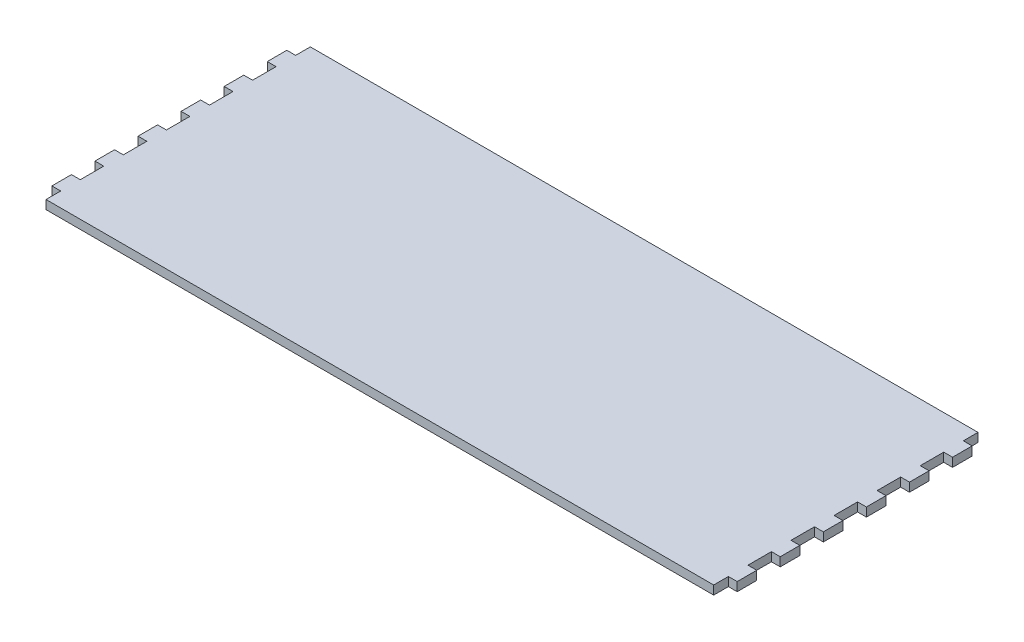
ISO-10303-21;
HEADER;
FILE_DESCRIPTION(('STEP AP214'),'2;1');
FILE_NAME('part.step','',(''),(''),'','','');
FILE_SCHEMA(('AUTOMOTIVE_DESIGN { 1 0 10303 214 1 1 1 1 }'));
ENDSEC;
DATA;
#1=APPLICATION_CONTEXT('core data for automotive mechanical design processes');
#2=APPLICATION_PROTOCOL_DEFINITION('international standard','automotive_design',2000,#1);
#3=PRODUCT_CONTEXT('',#1,'mechanical');
#4=PRODUCT('Part','Part','',(#3));
#5=PRODUCT_RELATED_PRODUCT_CATEGORY('part','',(#4));
#6=PRODUCT_DEFINITION_FORMATION('','',#4);
#7=PRODUCT_DEFINITION_CONTEXT('part definition',#1,'design');
#8=PRODUCT_DEFINITION('design','',#6,#7);
#9=PRODUCT_DEFINITION_SHAPE('','',#8);
#10=(LENGTH_UNIT() NAMED_UNIT(*) SI_UNIT(.MILLI.,.METRE.));
#11=(NAMED_UNIT(*) PLANE_ANGLE_UNIT() SI_UNIT($,.RADIAN.));
#12=(NAMED_UNIT(*) SI_UNIT($,.STERADIAN.) SOLID_ANGLE_UNIT());
#13=UNCERTAINTY_MEASURE_WITH_UNIT(LENGTH_MEASURE(1.E-05),#10,'distance_accuracy_value','');
#14=(GEOMETRIC_REPRESENTATION_CONTEXT(3) GLOBAL_UNCERTAINTY_ASSIGNED_CONTEXT((#13)) GLOBAL_UNIT_ASSIGNED_CONTEXT((#10,
#11,#12)) REPRESENTATION_CONTEXT('',''));
#15=CARTESIAN_POINT('',(0.,0.,0.));
#16=DIRECTION('',(0.,0.,1.));
#17=DIRECTION('',(1.,0.,0.));
#18=AXIS2_PLACEMENT_3D('',#15,#16,#17);
#19=CARTESIAN_POINT('',(341.,9.,-135.));
#20=DIRECTION('',(-1.,0.,0.));
#21=DIRECTION('',(0.,0.,1.));
#22=AXIS2_PLACEMENT_3D('',#19,#20,#21);
#23=PLANE('',#22);
#24=DIRECTION('',(0.,0.,-1.));
#25=VECTOR('',#24,1.);
#26=CARTESIAN_POINT('',(341.,9.,-135.));
#27=LINE('',#26,#25);
#28=CARTESIAN_POINT('',(341.,9.,-120.));
#29=VERTEX_POINT('',#28);
#30=CARTESIAN_POINT('',(341.,9.,-135.));
#31=VERTEX_POINT('',#30);
#32=EDGE_CURVE('E55',#29,#31,#27,.T.);
#33=ORIENTED_EDGE('',*,*,#32,.F.);
#34=DIRECTION('',(0.,1.,0.));
#35=VECTOR('',#34,1.);
#36=CARTESIAN_POINT('',(341.000000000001,-21.9317121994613,-120.));
#37=LINE('',#36,#35);
#38=CARTESIAN_POINT('',(341.000000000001,0.,-120.));
#39=VERTEX_POINT('',#38);
#40=EDGE_CURVE('E405',#39,#29,#37,.T.);
#41=ORIENTED_EDGE('',*,*,#40,.F.);
#42=DIRECTION('',(0.,0.,-1.));
#43=VECTOR('',#42,1.);
#44=CARTESIAN_POINT('',(341.,0.,-135.));
#45=LINE('',#44,#43);
#46=CARTESIAN_POINT('',(341.,0.,-135.));
#47=VERTEX_POINT('',#46);
#48=EDGE_CURVE('E804',#39,#47,#45,.T.);
#49=ORIENTED_EDGE('',*,*,#48,.T.);
#50=DIRECTION('',(0.,-1.,0.));
#51=VECTOR('',#50,1.);
#52=CARTESIAN_POINT('',(341.,9.,-135.));
#53=LINE('',#52,#51);
#54=EDGE_CURVE('E11',#31,#47,#53,.T.);
#55=ORIENTED_EDGE('',*,*,#54,.F.);
#56=EDGE_LOOP('',(#33,#41,#49,#55));
#57=FACE_BOUND('',#56,.T.);
#58=ADVANCED_FACE('F39',(#57),#23,.F.);
#59=CARTESIAN_POINT('',(341.000000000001,0.,-75.9999999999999));
#60=VERTEX_POINT('',#59);
#61=CARTESIAN_POINT('',(341.,0.,-99.9999999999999));
#62=VERTEX_POINT('',#61);
#63=EDGE_CURVE('E867',#60,#62,#45,.T.);
#64=ORIENTED_EDGE('',*,*,#63,.T.);
#65=DIRECTION('',(0.,1.,0.));
#66=VECTOR('',#65,1.);
#67=CARTESIAN_POINT('',(341.000000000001,-21.9317121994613,-99.9999999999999));
#68=LINE('',#67,#66);
#69=CARTESIAN_POINT('',(341.,9.,-99.9999999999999));
#70=VERTEX_POINT('',#69);
#71=EDGE_CURVE('E63',#62,#70,#68,.T.);
#72=ORIENTED_EDGE('',*,*,#71,.T.);
#73=CARTESIAN_POINT('',(341.,9.,-75.9999999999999));
#74=VERTEX_POINT('',#73);
#75=EDGE_CURVE('E396',#74,#70,#27,.T.);
#76=ORIENTED_EDGE('',*,*,#75,.F.);
#77=DIRECTION('',(0.,1.,0.));
#78=VECTOR('',#77,1.);
#79=CARTESIAN_POINT('',(341.000000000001,-21.9317121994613,-75.9999999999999));
#80=LINE('',#79,#78);
#81=EDGE_CURVE('E420',#60,#74,#80,.T.);
#82=ORIENTED_EDGE('',*,*,#81,.F.);
#83=EDGE_LOOP('',(#64,#72,#76,#82));
#84=FACE_BOUND('',#83,.T.);
#85=ADVANCED_FACE('F959',(#84),#23,.F.);
#86=CARTESIAN_POINT('',(341.,0.,-32.));
#87=VERTEX_POINT('',#86);
#88=CARTESIAN_POINT('',(341.,0.,-55.9999999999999));
#89=VERTEX_POINT('',#88);
#90=EDGE_CURVE('E869',#87,#89,#45,.T.);
#91=ORIENTED_EDGE('',*,*,#90,.T.);
#92=DIRECTION('',(0.,1.,0.));
#93=VECTOR('',#92,1.);
#94=CARTESIAN_POINT('',(341.000000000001,-21.9317121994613,-55.9999999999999));
#95=LINE('',#94,#93);
#96=CARTESIAN_POINT('',(341.,9.,-55.9999999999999));
#97=VERTEX_POINT('',#96);
#98=EDGE_CURVE('E434',#89,#97,#95,.T.);
#99=ORIENTED_EDGE('',*,*,#98,.T.);
#100=CARTESIAN_POINT('',(341.,9.,-31.9999999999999));
#101=VERTEX_POINT('',#100);
#102=EDGE_CURVE('E906',#101,#97,#27,.T.);
#103=ORIENTED_EDGE('',*,*,#102,.F.);
#104=DIRECTION('',(0.,1.,0.));
#105=VECTOR('',#104,1.);
#106=CARTESIAN_POINT('',(341.,-21.9317121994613,-32.));
#107=LINE('',#106,#105);
#108=EDGE_CURVE('E454',#87,#101,#107,.T.);
#109=ORIENTED_EDGE('',*,*,#108,.F.);
#110=EDGE_LOOP('',(#91,#99,#103,#109));
#111=FACE_BOUND('',#110,.T.);
#112=ADVANCED_FACE('F963',(#111),#23,.F.);
#113=CARTESIAN_POINT('',(341.,0.,12.0000000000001));
#114=VERTEX_POINT('',#113);
#115=CARTESIAN_POINT('',(341.,0.,-12.));
#116=VERTEX_POINT('',#115);
#117=EDGE_CURVE('E872',#114,#116,#45,.T.);
#118=ORIENTED_EDGE('',*,*,#117,.T.);
#119=DIRECTION('',(0.,1.,0.));
#120=VECTOR('',#119,1.);
#121=CARTESIAN_POINT('',(341.,-21.9317121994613,-12.));
#122=LINE('',#121,#120);
#123=CARTESIAN_POINT('',(341.,9.,-12.));
#124=VERTEX_POINT('',#123);
#125=EDGE_CURVE('E469',#116,#124,#122,.T.);
#126=ORIENTED_EDGE('',*,*,#125,.T.);
#127=CARTESIAN_POINT('',(341.,9.,12.0000000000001));
#128=VERTEX_POINT('',#127);
#129=EDGE_CURVE('E902',#128,#124,#27,.T.);
#130=ORIENTED_EDGE('',*,*,#129,.F.);
#131=DIRECTION('',(0.,1.,0.));
#132=VECTOR('',#131,1.);
#133=CARTESIAN_POINT('',(341.,-21.9317121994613,12.0000000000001));
#134=LINE('',#133,#132);
#135=EDGE_CURVE('E489',#114,#128,#134,.T.);
#136=ORIENTED_EDGE('',*,*,#135,.F.);
#137=EDGE_LOOP('',(#118,#126,#130,#136));
#138=FACE_BOUND('',#137,.T.);
#139=ADVANCED_FACE('F980',(#138),#23,.F.);
#140=CARTESIAN_POINT('',(341.,0.,56.));
#141=VERTEX_POINT('',#140);
#142=CARTESIAN_POINT('',(341.,0.,32.0000000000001));
#143=VERTEX_POINT('',#142);
#144=EDGE_CURVE('E876',#141,#143,#45,.T.);
#145=ORIENTED_EDGE('',*,*,#144,.T.);
#146=DIRECTION('',(0.,1.,0.));
#147=VECTOR('',#146,1.);
#148=CARTESIAN_POINT('',(341.,-21.9317121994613,32.0000000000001));
#149=LINE('',#148,#147);
#150=CARTESIAN_POINT('',(341.,9.,32.0000000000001));
#151=VERTEX_POINT('',#150);
#152=EDGE_CURVE('E504',#143,#151,#149,.T.);
#153=ORIENTED_EDGE('',*,*,#152,.T.);
#154=CARTESIAN_POINT('',(341.,9.,56.));
#155=VERTEX_POINT('',#154);
#156=EDGE_CURVE('E899',#155,#151,#27,.T.);
#157=ORIENTED_EDGE('',*,*,#156,.F.);
#158=DIRECTION('',(0.,1.,0.));
#159=VECTOR('',#158,1.);
#160=CARTESIAN_POINT('',(341.,-21.9317121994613,56.));
#161=LINE('',#160,#159);
#162=EDGE_CURVE('E524',#141,#155,#161,.T.);
#163=ORIENTED_EDGE('',*,*,#162,.F.);
#164=EDGE_LOOP('',(#145,#153,#157,#163));
#165=FACE_BOUND('',#164,.T.);
#166=ADVANCED_FACE('F973',(#165),#23,.F.);
#167=CARTESIAN_POINT('',(341.,0.,100.));
#168=VERTEX_POINT('',#167);
#169=CARTESIAN_POINT('',(341.,0.,76.0000000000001));
#170=VERTEX_POINT('',#169);
#171=EDGE_CURVE('E826',#168,#170,#45,.T.);
#172=ORIENTED_EDGE('',*,*,#171,.T.);
#173=DIRECTION('',(0.,1.,0.));
#174=VECTOR('',#173,1.);
#175=CARTESIAN_POINT('',(341.,-21.9317121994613,76.0000000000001));
#176=LINE('',#175,#174);
#177=CARTESIAN_POINT('',(341.,9.,76.0000000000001));
#178=VERTEX_POINT('',#177);
#179=EDGE_CURVE('E539',#170,#178,#176,.T.);
#180=ORIENTED_EDGE('',*,*,#179,.T.);
#181=CARTESIAN_POINT('',(341.,9.,100.));
#182=VERTEX_POINT('',#181);
#183=EDGE_CURVE('E809',#182,#178,#27,.T.);
#184=ORIENTED_EDGE('',*,*,#183,.F.);
#185=DIRECTION('',(0.,1.,0.));
#186=VECTOR('',#185,1.);
#187=CARTESIAN_POINT('',(341.,-21.9317121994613,100.));
#188=LINE('',#187,#186);
#189=EDGE_CURVE('E559',#168,#182,#188,.T.);
#190=ORIENTED_EDGE('',*,*,#189,.F.);
#191=EDGE_LOOP('',(#172,#180,#184,#190));
#192=FACE_BOUND('',#191,.T.);
#193=ADVANCED_FACE('F885',(#192),#23,.F.);
#194=CARTESIAN_POINT('',(-341.,9.,-135.));
#195=DIRECTION('',(1.,0.,0.));
#196=DIRECTION('',(0.,0.,-1.));
#197=AXIS2_PLACEMENT_3D('',#194,#195,#196);
#198=PLANE('',#197);
#199=DIRECTION('',(0.,0.,1.));
#200=VECTOR('',#199,1.);
#201=CARTESIAN_POINT('',(-341.,9.,-135.));
#202=LINE('',#201,#200);
#203=CARTESIAN_POINT('',(-341.,9.,-99.9999999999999));
#204=VERTEX_POINT('',#203);
#205=CARTESIAN_POINT('',(-341.,9.,-75.9999999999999));
#206=VERTEX_POINT('',#205);
#207=EDGE_CURVE('E818',#204,#206,#202,.T.);
#208=ORIENTED_EDGE('',*,*,#207,.F.);
#209=DIRECTION('',(0.,1.,0.));
#210=VECTOR('',#209,1.);
#211=CARTESIAN_POINT('',(-341.000000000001,-21.9317121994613,-99.9999999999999));
#212=LINE('',#211,#210);
#213=CARTESIAN_POINT('',(-341.000000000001,0.,-99.9999999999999));
#214=VERTEX_POINT('',#213);
#215=EDGE_CURVE('E613',#214,#204,#212,.T.);
#216=ORIENTED_EDGE('',*,*,#215,.F.);
#217=DIRECTION('',(0.,0.,1.));
#218=VECTOR('',#217,1.);
#219=CARTESIAN_POINT('',(-341.,0.,-135.));
#220=LINE('',#219,#218);
#221=CARTESIAN_POINT('',(-341.,0.,-75.9999999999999));
#222=VERTEX_POINT('',#221);
#223=EDGE_CURVE('E834',#214,#222,#220,.T.);
#224=ORIENTED_EDGE('',*,*,#223,.T.);
#225=DIRECTION('',(0.,1.,0.));
#226=VECTOR('',#225,1.);
#227=CARTESIAN_POINT('',(-341.000000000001,-21.9317121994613,-75.9999999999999));
#228=LINE('',#227,#226);
#229=EDGE_CURVE('E654',#222,#206,#228,.T.);
#230=ORIENTED_EDGE('',*,*,#229,.T.);
#231=EDGE_LOOP('',(#208,#216,#224,#230));
#232=FACE_BOUND('',#231,.T.);
#233=ADVANCED_FACE('F972',(#232),#198,.F.);
#234=CARTESIAN_POINT('',(-341.,9.,-55.9999999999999));
#235=VERTEX_POINT('',#234);
#236=CARTESIAN_POINT('',(-341.,9.,-32.));
#237=VERTEX_POINT('',#236);
#238=EDGE_CURVE('E1417',#235,#237,#202,.T.);
#239=ORIENTED_EDGE('',*,*,#238,.F.);
#240=DIRECTION('',(0.,1.,0.));
#241=VECTOR('',#240,1.);
#242=CARTESIAN_POINT('',(-341.000000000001,-21.9317121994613,-55.9999999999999));
#243=LINE('',#242,#241);
#244=CARTESIAN_POINT('',(-341.000000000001,0.,-55.9999999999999));
#245=VERTEX_POINT('',#244);
#246=EDGE_CURVE('E648',#245,#235,#243,.T.);
#247=ORIENTED_EDGE('',*,*,#246,.F.);
#248=CARTESIAN_POINT('',(-341.,0.,-32.));
#249=VERTEX_POINT('',#248);
#250=EDGE_CURVE('E915',#245,#249,#220,.T.);
#251=ORIENTED_EDGE('',*,*,#250,.T.);
#252=DIRECTION('',(0.,1.,0.));
#253=VECTOR('',#252,1.);
#254=CARTESIAN_POINT('',(-341.,-21.9317121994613,-32.));
#255=LINE('',#254,#253);
#256=EDGE_CURVE('E690',#249,#237,#255,.T.);
#257=ORIENTED_EDGE('',*,*,#256,.T.);
#258=EDGE_LOOP('',(#239,#247,#251,#257));
#259=FACE_BOUND('',#258,.T.);
#260=ADVANCED_FACE('F978',(#259),#198,.F.);
#261=CARTESIAN_POINT('',(-341.,9.,-12.));
#262=VERTEX_POINT('',#261);
#263=CARTESIAN_POINT('',(-341.,9.,12.0000000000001));
#264=VERTEX_POINT('',#263);
#265=EDGE_CURVE('E1430',#262,#264,#202,.T.);
#266=ORIENTED_EDGE('',*,*,#265,.F.);
#267=DIRECTION('',(0.,1.,0.));
#268=VECTOR('',#267,1.);
#269=CARTESIAN_POINT('',(-341.,-21.9317121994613,-12.));
#270=LINE('',#269,#268);
#271=CARTESIAN_POINT('',(-341.,0.,-12.));
#272=VERTEX_POINT('',#271);
#273=EDGE_CURVE('E684',#272,#262,#270,.T.);
#274=ORIENTED_EDGE('',*,*,#273,.F.);
#275=CARTESIAN_POINT('',(-341.,0.,12.0000000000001));
#276=VERTEX_POINT('',#275);
#277=EDGE_CURVE('E917',#272,#276,#220,.T.);
#278=ORIENTED_EDGE('',*,*,#277,.T.);
#279=DIRECTION('',(0.,1.,0.));
#280=VECTOR('',#279,1.);
#281=CARTESIAN_POINT('',(-341.,-21.9317121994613,12.0000000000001));
#282=LINE('',#281,#280);
#283=EDGE_CURVE('E726',#276,#264,#282,.T.);
#284=ORIENTED_EDGE('',*,*,#283,.T.);
#285=EDGE_LOOP('',(#266,#274,#278,#284));
#286=FACE_BOUND('',#285,.T.);
#287=ADVANCED_FACE('F1472',(#286),#198,.F.);
#288=CARTESIAN_POINT('',(-341.,9.,32.0000000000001));
#289=VERTEX_POINT('',#288);
#290=CARTESIAN_POINT('',(-341.,9.,56.));
#291=VERTEX_POINT('',#290);
#292=EDGE_CURVE('E1432',#289,#291,#202,.T.);
#293=ORIENTED_EDGE('',*,*,#292,.F.);
#294=DIRECTION('',(0.,1.,0.));
#295=VECTOR('',#294,1.);
#296=CARTESIAN_POINT('',(-341.,-21.9317121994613,32.0000000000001));
#297=LINE('',#296,#295);
#298=CARTESIAN_POINT('',(-341.,0.,32.0000000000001));
#299=VERTEX_POINT('',#298);
#300=EDGE_CURVE('E720',#299,#289,#297,.T.);
#301=ORIENTED_EDGE('',*,*,#300,.F.);
#302=CARTESIAN_POINT('',(-341.,0.,56.));
#303=VERTEX_POINT('',#302);
#304=EDGE_CURVE('E919',#299,#303,#220,.T.);
#305=ORIENTED_EDGE('',*,*,#304,.T.);
#306=DIRECTION('',(0.,1.,0.));
#307=VECTOR('',#306,1.);
#308=CARTESIAN_POINT('',(-341.,-21.9317121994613,56.));
#309=LINE('',#308,#307);
#310=EDGE_CURVE('E762',#303,#291,#309,.T.);
#311=ORIENTED_EDGE('',*,*,#310,.T.);
#312=EDGE_LOOP('',(#293,#301,#305,#311));
#313=FACE_BOUND('',#312,.T.);
#314=ADVANCED_FACE('F1457',(#313),#198,.F.);
#315=CARTESIAN_POINT('',(-341.,9.,76.0000000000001));
#316=VERTEX_POINT('',#315);
#317=CARTESIAN_POINT('',(-341.,9.,100.));
#318=VERTEX_POINT('',#317);
#319=EDGE_CURVE('E1434',#316,#318,#202,.T.);
#320=ORIENTED_EDGE('',*,*,#319,.F.);
#321=DIRECTION('',(0.,1.,0.));
#322=VECTOR('',#321,1.);
#323=CARTESIAN_POINT('',(-341.,-21.9317121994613,76.0000000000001));
#324=LINE('',#323,#322);
#325=CARTESIAN_POINT('',(-341.,0.,76.0000000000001));
#326=VERTEX_POINT('',#325);
#327=EDGE_CURVE('E756',#326,#316,#324,.T.);
#328=ORIENTED_EDGE('',*,*,#327,.F.);
#329=CARTESIAN_POINT('',(-341.,0.,100.));
#330=VERTEX_POINT('',#329);
#331=EDGE_CURVE('E921',#326,#330,#220,.T.);
#332=ORIENTED_EDGE('',*,*,#331,.T.);
#333=DIRECTION('',(0.,1.,0.));
#334=VECTOR('',#333,1.);
#335=CARTESIAN_POINT('',(-341.,-21.9317121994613,100.));
#336=LINE('',#335,#334);
#337=EDGE_CURVE('E788',#330,#318,#336,.T.);
#338=ORIENTED_EDGE('',*,*,#337,.T.);
#339=EDGE_LOOP('',(#320,#328,#332,#338));
#340=FACE_BOUND('',#339,.T.);
#341=ADVANCED_FACE('F969',(#340),#198,.F.);
#342=DIRECTION('',(0.,1.,0.));
#343=VECTOR('',#342,1.);
#344=CARTESIAN_POINT('',(-341.,-21.9317121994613,120.));
#345=LINE('',#344,#343);
#346=CARTESIAN_POINT('',(-341.,0.,120.));
#347=VERTEX_POINT('',#346);
#348=CARTESIAN_POINT('',(-341.,9.,120.));
#349=VERTEX_POINT('',#348);
#350=EDGE_CURVE('E773',#347,#349,#345,.T.);
#351=ORIENTED_EDGE('',*,*,#350,.F.);
#352=CARTESIAN_POINT('',(-341.,0.,135.));
#353=VERTEX_POINT('',#352);
#354=EDGE_CURVE('E829',#347,#353,#220,.T.);
#355=ORIENTED_EDGE('',*,*,#354,.T.);
#356=DIRECTION('',(0.,-1.,0.));
#357=VECTOR('',#356,1.);
#358=CARTESIAN_POINT('',(-341.,9.,135.));
#359=LINE('',#358,#357);
#360=CARTESIAN_POINT('',(-341.,9.,135.));
#361=VERTEX_POINT('',#360);
#362=EDGE_CURVE('E840',#361,#353,#359,.T.);
#363=ORIENTED_EDGE('',*,*,#362,.F.);
#364=EDGE_CURVE('E812',#349,#361,#202,.T.);
#365=ORIENTED_EDGE('',*,*,#364,.F.);
#366=EDGE_LOOP('',(#351,#355,#363,#365));
#367=FACE_BOUND('',#366,.T.);
#368=ADVANCED_FACE('F926',(#367),#198,.F.);
#369=CARTESIAN_POINT('',(341.,0.,135.));
#370=VERTEX_POINT('',#369);
#371=CARTESIAN_POINT('',(341.,0.,120.));
#372=VERTEX_POINT('',#371);
#373=EDGE_CURVE('E822',#370,#372,#45,.T.);
#374=ORIENTED_EDGE('',*,*,#373,.T.);
#375=DIRECTION('',(0.,1.,0.));
#376=VECTOR('',#375,1.);
#377=CARTESIAN_POINT('',(341.,-21.9317121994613,120.));
#378=LINE('',#377,#376);
#379=CARTESIAN_POINT('',(341.,9.,120.));
#380=VERTEX_POINT('',#379);
#381=EDGE_CURVE('E574',#372,#380,#378,.T.);
#382=ORIENTED_EDGE('',*,*,#381,.T.);
#383=CARTESIAN_POINT('',(341.,9.,135.));
#384=VERTEX_POINT('',#383);
#385=EDGE_CURVE('E805',#384,#380,#27,.T.);
#386=ORIENTED_EDGE('',*,*,#385,.F.);
#387=DIRECTION('',(0.,-1.,0.));
#388=VECTOR('',#387,1.);
#389=CARTESIAN_POINT('',(341.,9.,135.));
#390=LINE('',#389,#388);
#391=EDGE_CURVE('E821',#384,#370,#390,.T.);
#392=ORIENTED_EDGE('',*,*,#391,.T.);
#393=EDGE_LOOP('',(#374,#382,#386,#392));
#394=FACE_BOUND('',#393,.T.);
#395=ADVANCED_FACE('F41',(#394),#23,.F.);
#396=CARTESIAN_POINT('',(-341.,9.,-135.));
#397=DIRECTION('',(0.,0.,1.));
#398=DIRECTION('',(1.,0.,0.));
#399=AXIS2_PLACEMENT_3D('',#396,#397,#398);
#400=PLANE('',#399);
#401=DIRECTION('',(-1.,0.,0.));
#402=VECTOR('',#401,1.);
#403=CARTESIAN_POINT('',(-341.,0.,-135.));
#404=LINE('',#403,#402);
#405=CARTESIAN_POINT('',(-341.,0.,-135.));
#406=VERTEX_POINT('',#405);
#407=EDGE_CURVE('E825',#47,#406,#404,.T.);
#408=ORIENTED_EDGE('',*,*,#407,.T.);
#409=DIRECTION('',(0.,-1.,0.));
#410=VECTOR('',#409,1.);
#411=CARTESIAN_POINT('',(-341.,9.,-135.));
#412=LINE('',#411,#410);
#413=CARTESIAN_POINT('',(-341.,9.,-135.));
#414=VERTEX_POINT('',#413);
#415=EDGE_CURVE('E48',#414,#406,#412,.T.);
#416=ORIENTED_EDGE('',*,*,#415,.F.);
#417=DIRECTION('',(-1.,0.,0.));
#418=VECTOR('',#417,1.);
#419=CARTESIAN_POINT('',(-341.,9.,-135.));
#420=LINE('',#419,#418);
#421=EDGE_CURVE('E808',#31,#414,#420,.T.);
#422=ORIENTED_EDGE('',*,*,#421,.F.);
#423=ORIENTED_EDGE('',*,*,#54,.T.);
#424=EDGE_LOOP('',(#408,#416,#422,#423));
#425=FACE_BOUND('',#424,.T.);
#426=ADVANCED_FACE('F864',(#425),#400,.F.);
#427=CARTESIAN_POINT('',(-341.,0.,-120.));
#428=VERTEX_POINT('',#427);
#429=EDGE_CURVE('E830',#406,#428,#220,.T.);
#430=ORIENTED_EDGE('',*,*,#429,.T.);
#431=DIRECTION('',(0.,1.,0.));
#432=VECTOR('',#431,1.);
#433=CARTESIAN_POINT('',(-341.000000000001,-21.9317121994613,-120.));
#434=LINE('',#433,#432);
#435=CARTESIAN_POINT('',(-341.,9.,-120.));
#436=VERTEX_POINT('',#435);
#437=EDGE_CURVE('E619',#428,#436,#434,.T.);
#438=ORIENTED_EDGE('',*,*,#437,.T.);
#439=EDGE_CURVE('E813',#414,#436,#202,.T.);
#440=ORIENTED_EDGE('',*,*,#439,.F.);
#441=ORIENTED_EDGE('',*,*,#415,.T.);
#442=EDGE_LOOP('',(#430,#438,#440,#441));
#443=FACE_BOUND('',#442,.T.);
#444=ADVANCED_FACE('F849',(#443),#198,.F.);
#445=CARTESIAN_POINT('',(-341.,9.,135.));
#446=DIRECTION('',(0.,0.,-1.));
#447=DIRECTION('',(-1.,0.,0.));
#448=AXIS2_PLACEMENT_3D('',#445,#446,#447);
#449=PLANE('',#448);
#450=DIRECTION('',(1.,0.,0.));
#451=VECTOR('',#450,1.);
#452=CARTESIAN_POINT('',(-341.,0.,135.));
#453=LINE('',#452,#451);
#454=EDGE_CURVE('E833',#353,#370,#453,.T.);
#455=ORIENTED_EDGE('',*,*,#454,.T.);
#456=ORIENTED_EDGE('',*,*,#391,.F.);
#457=DIRECTION('',(1.,0.,0.));
#458=VECTOR('',#457,1.);
#459=CARTESIAN_POINT('',(-341.,9.,135.));
#460=LINE('',#459,#458);
#461=EDGE_CURVE('E817',#361,#384,#460,.T.);
#462=ORIENTED_EDGE('',*,*,#461,.F.);
#463=ORIENTED_EDGE('',*,*,#362,.T.);
#464=EDGE_LOOP('',(#455,#456,#462,#463));
#465=FACE_BOUND('',#464,.T.);
#466=ADVANCED_FACE('F931',(#465),#449,.F.);
#467=CARTESIAN_POINT('',(0.,9.,0.));
#468=DIRECTION('',(0.,1.,0.));
#469=DIRECTION('',(0.,0.,1.));
#470=AXIS2_PLACEMENT_3D('',#467,#468,#469);
#471=PLANE('',#470);
#472=ORIENTED_EDGE('',*,*,#385,.T.);
#473=DIRECTION('',(1.,0.,0.));
#474=VECTOR('',#473,1.);
#475=CARTESIAN_POINT('',(341.,9.,120.));
#476=LINE('',#475,#474);
#477=CARTESIAN_POINT('',(350.,9.,120.));
#478=VERTEX_POINT('',#477);
#479=EDGE_CURVE('E554',#380,#478,#476,.T.);
#480=ORIENTED_EDGE('',*,*,#479,.T.);
#481=DIRECTION('',(0.,0.,-1.));
#482=VECTOR('',#481,1.);
#483=CARTESIAN_POINT('',(350.,9.,120.));
#484=LINE('',#483,#482);
#485=CARTESIAN_POINT('',(350.,9.,100.));
#486=VERTEX_POINT('',#485);
#487=EDGE_CURVE('E566',#478,#486,#484,.T.);
#488=ORIENTED_EDGE('',*,*,#487,.T.);
#489=DIRECTION('',(-1.,0.,0.));
#490=VECTOR('',#489,1.);
#491=CARTESIAN_POINT('',(341.,9.,100.));
#492=LINE('',#491,#490);
#493=EDGE_CURVE('E570',#486,#182,#492,.T.);
#494=ORIENTED_EDGE('',*,*,#493,.T.);
#495=ORIENTED_EDGE('',*,*,#183,.T.);
#496=DIRECTION('',(1.,0.,0.));
#497=VECTOR('',#496,1.);
#498=CARTESIAN_POINT('',(341.,9.,76.0000000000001));
#499=LINE('',#498,#497);
#500=CARTESIAN_POINT('',(350.,9.,76.0000000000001));
#501=VERTEX_POINT('',#500);
#502=EDGE_CURVE('E519',#178,#501,#499,.T.);
#503=ORIENTED_EDGE('',*,*,#502,.T.);
#504=DIRECTION('',(0.,0.,-1.));
#505=VECTOR('',#504,1.);
#506=CARTESIAN_POINT('',(350.,9.,76.0000000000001));
#507=LINE('',#506,#505);
#508=CARTESIAN_POINT('',(350.,9.,56.0000000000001));
#509=VERTEX_POINT('',#508);
#510=EDGE_CURVE('E531',#501,#509,#507,.T.);
#511=ORIENTED_EDGE('',*,*,#510,.T.);
#512=DIRECTION('',(-1.,0.,0.));
#513=VECTOR('',#512,1.);
#514=CARTESIAN_POINT('',(341.,9.,56.));
#515=LINE('',#514,#513);
#516=EDGE_CURVE('E535',#509,#155,#515,.T.);
#517=ORIENTED_EDGE('',*,*,#516,.T.);
#518=ORIENTED_EDGE('',*,*,#156,.T.);
#519=DIRECTION('',(1.,0.,0.));
#520=VECTOR('',#519,1.);
#521=CARTESIAN_POINT('',(341.,9.,32.0000000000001));
#522=LINE('',#521,#520);
#523=CARTESIAN_POINT('',(350.,9.,32.0000000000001));
#524=VERTEX_POINT('',#523);
#525=EDGE_CURVE('E484',#151,#524,#522,.T.);
#526=ORIENTED_EDGE('',*,*,#525,.T.);
#527=DIRECTION('',(0.,0.,-1.));
#528=VECTOR('',#527,1.);
#529=CARTESIAN_POINT('',(350.,9.,32.0000000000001));
#530=LINE('',#529,#528);
#531=CARTESIAN_POINT('',(350.,9.,12.0000000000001));
#532=VERTEX_POINT('',#531);
#533=EDGE_CURVE('E496',#524,#532,#530,.T.);
#534=ORIENTED_EDGE('',*,*,#533,.T.);
#535=DIRECTION('',(-1.,0.,0.));
#536=VECTOR('',#535,1.);
#537=CARTESIAN_POINT('',(341.,9.,12.0000000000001));
#538=LINE('',#537,#536);
#539=EDGE_CURVE('E500',#532,#128,#538,.T.);
#540=ORIENTED_EDGE('',*,*,#539,.T.);
#541=ORIENTED_EDGE('',*,*,#129,.T.);
#542=DIRECTION('',(1.,0.,0.));
#543=VECTOR('',#542,1.);
#544=CARTESIAN_POINT('',(341.,9.,-12.));
#545=LINE('',#544,#543);
#546=CARTESIAN_POINT('',(350.,9.,-11.9999999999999));
#547=VERTEX_POINT('',#546);
#548=EDGE_CURVE('E449',#124,#547,#545,.T.);
#549=ORIENTED_EDGE('',*,*,#548,.T.);
#550=DIRECTION('',(0.,0.,-1.));
#551=VECTOR('',#550,1.);
#552=CARTESIAN_POINT('',(350.,9.,-11.9999999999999));
#553=LINE('',#552,#551);
#554=CARTESIAN_POINT('',(350.,9.,-31.9999999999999));
#555=VERTEX_POINT('',#554);
#556=EDGE_CURVE('E461',#547,#555,#553,.T.);
#557=ORIENTED_EDGE('',*,*,#556,.T.);
#558=DIRECTION('',(-1.,0.,0.));
#559=VECTOR('',#558,1.);
#560=CARTESIAN_POINT('',(341.,9.,-32.));
#561=LINE('',#560,#559);
#562=EDGE_CURVE('E465',#555,#101,#561,.T.);
#563=ORIENTED_EDGE('',*,*,#562,.T.);
#564=ORIENTED_EDGE('',*,*,#102,.T.);
#565=DIRECTION('',(1.,0.,0.));
#566=VECTOR('',#565,1.);
#567=CARTESIAN_POINT('',(341.000000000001,9.,-55.9999999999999));
#568=LINE('',#567,#566);
#569=CARTESIAN_POINT('',(350.000000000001,9.,-55.9999999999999));
#570=VERTEX_POINT('',#569);
#571=EDGE_CURVE('E415',#97,#570,#568,.T.);
#572=ORIENTED_EDGE('',*,*,#571,.T.);
#573=DIRECTION('',(0.,0.,-1.));
#574=VECTOR('',#573,1.);
#575=CARTESIAN_POINT('',(350.000000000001,9.,-55.9999999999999));
#576=LINE('',#575,#574);
#577=CARTESIAN_POINT('',(350.000000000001,9.,-75.9999999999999));
#578=VERTEX_POINT('',#577);
#579=EDGE_CURVE('E427',#570,#578,#576,.T.);
#580=ORIENTED_EDGE('',*,*,#579,.T.);
#581=DIRECTION('',(-1.,0.,0.));
#582=VECTOR('',#581,1.);
#583=CARTESIAN_POINT('',(341.000000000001,9.,-75.9999999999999));
#584=LINE('',#583,#582);
#585=EDGE_CURVE('E431',#578,#74,#584,.T.);
#586=ORIENTED_EDGE('',*,*,#585,.T.);
#587=ORIENTED_EDGE('',*,*,#75,.T.);
#588=DIRECTION('',(1.,0.,0.));
#589=VECTOR('',#588,1.);
#590=CARTESIAN_POINT('',(341.000000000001,9.,-99.9999999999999));
#591=LINE('',#590,#589);
#592=CARTESIAN_POINT('',(350.000000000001,9.,-99.9999999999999));
#593=VERTEX_POINT('',#592);
#594=EDGE_CURVE('E375',#70,#593,#591,.T.);
#595=ORIENTED_EDGE('',*,*,#594,.T.);
#596=DIRECTION('',(0.,0.,-1.));
#597=VECTOR('',#596,1.);
#598=CARTESIAN_POINT('',(350.000000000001,9.,-99.9999999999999));
#599=LINE('',#598,#597);
#600=CARTESIAN_POINT('',(350.000000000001,9.,-120.));
#601=VERTEX_POINT('',#600);
#602=EDGE_CURVE('E384',#593,#601,#599,.T.);
#603=ORIENTED_EDGE('',*,*,#602,.T.);
#604=DIRECTION('',(-1.,0.,0.));
#605=VECTOR('',#604,1.);
#606=CARTESIAN_POINT('',(341.000000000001,9.,-120.));
#607=LINE('',#606,#605);
#608=EDGE_CURVE('E391',#601,#29,#607,.T.);
#609=ORIENTED_EDGE('',*,*,#608,.T.);
#610=ORIENTED_EDGE('',*,*,#32,.T.);
#611=ORIENTED_EDGE('',*,*,#421,.T.);
#612=ORIENTED_EDGE('',*,*,#439,.T.);
#613=DIRECTION('',(-1.,0.,0.));
#614=VECTOR('',#613,1.);
#615=CARTESIAN_POINT('',(-341.000000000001,9.,-120.));
#616=LINE('',#615,#614);
#617=CARTESIAN_POINT('',(-350.000000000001,9.,-120.));
#618=VERTEX_POINT('',#617);
#619=EDGE_CURVE('E605',#436,#618,#616,.T.);
#620=ORIENTED_EDGE('',*,*,#619,.T.);
#621=DIRECTION('',(0.,0.,1.));
#622=VECTOR('',#621,1.);
#623=CARTESIAN_POINT('',(-350.000000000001,9.,-99.9999999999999));
#624=LINE('',#623,#622);
#625=CARTESIAN_POINT('',(-350.000000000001,9.,-99.9999999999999));
#626=VERTEX_POINT('',#625);
#627=EDGE_CURVE('E609',#618,#626,#624,.T.);
#628=ORIENTED_EDGE('',*,*,#627,.T.);
#629=DIRECTION('',(1.,0.,0.));
#630=VECTOR('',#629,1.);
#631=CARTESIAN_POINT('',(-341.000000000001,9.,-99.9999999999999));
#632=LINE('',#631,#630);
#633=EDGE_CURVE('E589',#626,#204,#632,.T.);
#634=ORIENTED_EDGE('',*,*,#633,.T.);
#635=ORIENTED_EDGE('',*,*,#207,.T.);
#636=DIRECTION('',(-1.,0.,0.));
#637=VECTOR('',#636,1.);
#638=CARTESIAN_POINT('',(-341.000000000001,9.,-75.9999999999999));
#639=LINE('',#638,#637);
#640=CARTESIAN_POINT('',(-350.000000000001,9.,-75.9999999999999));
#641=VERTEX_POINT('',#640);
#642=EDGE_CURVE('E640',#206,#641,#639,.T.);
#643=ORIENTED_EDGE('',*,*,#642,.T.);
#644=DIRECTION('',(0.,0.,1.));
#645=VECTOR('',#644,1.);
#646=CARTESIAN_POINT('',(-350.000000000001,9.,-55.9999999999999));
#647=LINE('',#646,#645);
#648=CARTESIAN_POINT('',(-350.000000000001,9.,-55.9999999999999));
#649=VERTEX_POINT('',#648);
#650=EDGE_CURVE('E644',#641,#649,#647,.T.);
#651=ORIENTED_EDGE('',*,*,#650,.T.);
#652=DIRECTION('',(1.,0.,0.));
#653=VECTOR('',#652,1.);
#654=CARTESIAN_POINT('',(-341.000000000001,9.,-55.9999999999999));
#655=LINE('',#654,#653);
#656=EDGE_CURVE('E601',#649,#235,#655,.T.);
#657=ORIENTED_EDGE('',*,*,#656,.T.);
#658=ORIENTED_EDGE('',*,*,#238,.T.);
#659=DIRECTION('',(-1.,0.,0.));
#660=VECTOR('',#659,1.);
#661=CARTESIAN_POINT('',(-341.,9.,-32.));
#662=LINE('',#661,#660);
#663=CARTESIAN_POINT('',(-350.,9.,-31.9999999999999));
#664=VERTEX_POINT('',#663);
#665=EDGE_CURVE('E676',#237,#664,#662,.T.);
#666=ORIENTED_EDGE('',*,*,#665,.T.);
#667=DIRECTION('',(0.,0.,1.));
#668=VECTOR('',#667,1.);
#669=CARTESIAN_POINT('',(-350.,9.,-11.9999999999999));
#670=LINE('',#669,#668);
#671=CARTESIAN_POINT('',(-350.,9.,-11.9999999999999));
#672=VERTEX_POINT('',#671);
#673=EDGE_CURVE('E680',#664,#672,#670,.T.);
#674=ORIENTED_EDGE('',*,*,#673,.T.);
#675=DIRECTION('',(1.,0.,0.));
#676=VECTOR('',#675,1.);
#677=CARTESIAN_POINT('',(-341.,9.,-12.));
#678=LINE('',#677,#676);
#679=EDGE_CURVE('E636',#672,#262,#678,.T.);
#680=ORIENTED_EDGE('',*,*,#679,.T.);
#681=ORIENTED_EDGE('',*,*,#265,.T.);
#682=DIRECTION('',(-1.,0.,0.));
#683=VECTOR('',#682,1.);
#684=CARTESIAN_POINT('',(-341.,9.,12.0000000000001));
#685=LINE('',#684,#683);
#686=CARTESIAN_POINT('',(-350.,9.,12.0000000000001));
#687=VERTEX_POINT('',#686);
#688=EDGE_CURVE('E712',#264,#687,#685,.T.);
#689=ORIENTED_EDGE('',*,*,#688,.T.);
#690=DIRECTION('',(0.,0.,1.));
#691=VECTOR('',#690,1.);
#692=CARTESIAN_POINT('',(-350.,9.,32.0000000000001));
#693=LINE('',#692,#691);
#694=CARTESIAN_POINT('',(-350.,9.,32.0000000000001));
#695=VERTEX_POINT('',#694);
#696=EDGE_CURVE('E716',#687,#695,#693,.T.);
#697=ORIENTED_EDGE('',*,*,#696,.T.);
#698=DIRECTION('',(1.,0.,0.));
#699=VECTOR('',#698,1.);
#700=CARTESIAN_POINT('',(-341.,9.,32.0000000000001));
#701=LINE('',#700,#699);
#702=EDGE_CURVE('E672',#695,#289,#701,.T.);
#703=ORIENTED_EDGE('',*,*,#702,.T.);
#704=ORIENTED_EDGE('',*,*,#292,.T.);
#705=DIRECTION('',(-1.,0.,0.));
#706=VECTOR('',#705,1.);
#707=CARTESIAN_POINT('',(-341.,9.,56.));
#708=LINE('',#707,#706);
#709=CARTESIAN_POINT('',(-350.,9.,56.0000000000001));
#710=VERTEX_POINT('',#709);
#711=EDGE_CURVE('E748',#291,#710,#708,.T.);
#712=ORIENTED_EDGE('',*,*,#711,.T.);
#713=DIRECTION('',(0.,0.,1.));
#714=VECTOR('',#713,1.);
#715=CARTESIAN_POINT('',(-350.,9.,76.0000000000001));
#716=LINE('',#715,#714);
#717=CARTESIAN_POINT('',(-350.,9.,76.0000000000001));
#718=VERTEX_POINT('',#717);
#719=EDGE_CURVE('E752',#710,#718,#716,.T.);
#720=ORIENTED_EDGE('',*,*,#719,.T.);
#721=DIRECTION('',(1.,0.,0.));
#722=VECTOR('',#721,1.);
#723=CARTESIAN_POINT('',(-341.,9.,76.0000000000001));
#724=LINE('',#723,#722);
#725=EDGE_CURVE('E708',#718,#316,#724,.T.);
#726=ORIENTED_EDGE('',*,*,#725,.T.);
#727=ORIENTED_EDGE('',*,*,#319,.T.);
#728=DIRECTION('',(-1.,0.,0.));
#729=VECTOR('',#728,1.);
#730=CARTESIAN_POINT('',(-341.,9.,100.));
#731=LINE('',#730,#729);
#732=CARTESIAN_POINT('',(-350.,9.,100.));
#733=VERTEX_POINT('',#732);
#734=EDGE_CURVE('E744',#318,#733,#731,.T.);
#735=ORIENTED_EDGE('',*,*,#734,.T.);
#736=DIRECTION('',(0.,0.,1.));
#737=VECTOR('',#736,1.);
#738=CARTESIAN_POINT('',(-350.,9.,120.));
#739=LINE('',#738,#737);
#740=CARTESIAN_POINT('',(-350.,9.,120.));
#741=VERTEX_POINT('',#740);
#742=EDGE_CURVE('E780',#733,#741,#739,.T.);
#743=ORIENTED_EDGE('',*,*,#742,.T.);
#744=DIRECTION('',(1.,0.,0.));
#745=VECTOR('',#744,1.);
#746=CARTESIAN_POINT('',(-341.,9.,120.));
#747=LINE('',#746,#745);
#748=EDGE_CURVE('E784',#741,#349,#747,.T.);
#749=ORIENTED_EDGE('',*,*,#748,.T.);
#750=ORIENTED_EDGE('',*,*,#364,.T.);
#751=ORIENTED_EDGE('',*,*,#461,.T.);
#752=EDGE_LOOP('',(#472,#480,#488,#494,#495,#503,#511,#517,#518,#526,#534,#540,#541,#549,#557,
#563,#564,#572,#580,#586,#587,#595,#603,#609,#610,#611,#612,#620,#628,#634,#635,#643,#651,#657,
#658,#666,#674,#680,#681,#689,#697,#703,#704,#712,#720,#726,#727,#735,#743,#749,#750,#751));
#753=FACE_BOUND('',#752,.T.);
#754=ADVANCED_FACE('F394',(#753),#471,.T.);
#755=CARTESIAN_POINT('',(0.,0.,0.));
#756=DIRECTION('',(0.,1.,0.));
#757=DIRECTION('',(0.,0.,1.));
#758=AXIS2_PLACEMENT_3D('',#755,#756,#757);
#759=PLANE('',#758);
#760=ORIENTED_EDGE('',*,*,#373,.F.);
#761=ORIENTED_EDGE('',*,*,#454,.F.);
#762=ORIENTED_EDGE('',*,*,#354,.F.);
#763=DIRECTION('',(-1.,0.,0.));
#764=VECTOR('',#763,1.);
#765=CARTESIAN_POINT('',(-341.,0.,120.));
#766=LINE('',#765,#764);
#767=CARTESIAN_POINT('',(-350.,0.,120.));
#768=VERTEX_POINT('',#767);
#769=EDGE_CURVE('E772',#347,#768,#766,.T.);
#770=ORIENTED_EDGE('',*,*,#769,.T.);
#771=DIRECTION('',(0.,0.,-1.));
#772=VECTOR('',#771,1.);
#773=CARTESIAN_POINT('',(-350.,0.,120.));
#774=LINE('',#773,#772);
#775=CARTESIAN_POINT('',(-350.,0.,100.));
#776=VERTEX_POINT('',#775);
#777=EDGE_CURVE('E769',#768,#776,#774,.T.);
#778=ORIENTED_EDGE('',*,*,#777,.T.);
#779=DIRECTION('',(1.,0.,0.));
#780=VECTOR('',#779,1.);
#781=CARTESIAN_POINT('',(-341.,0.,100.));
#782=LINE('',#781,#780);
#783=EDGE_CURVE('E776',#776,#330,#782,.T.);
#784=ORIENTED_EDGE('',*,*,#783,.T.);
#785=ORIENTED_EDGE('',*,*,#331,.F.);
#786=DIRECTION('',(-1.,0.,0.));
#787=VECTOR('',#786,1.);
#788=CARTESIAN_POINT('',(-341.,0.,76.0000000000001));
#789=LINE('',#788,#787);
#790=CARTESIAN_POINT('',(-350.,0.,76.0000000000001));
#791=VERTEX_POINT('',#790);
#792=EDGE_CURVE('E741',#326,#791,#789,.T.);
#793=ORIENTED_EDGE('',*,*,#792,.T.);
#794=DIRECTION('',(0.,0.,-1.));
#795=VECTOR('',#794,1.);
#796=CARTESIAN_POINT('',(-350.,0.,76.0000000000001));
#797=LINE('',#796,#795);
#798=CARTESIAN_POINT('',(-350.,0.,56.0000000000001));
#799=VERTEX_POINT('',#798);
#800=EDGE_CURVE('E737',#791,#799,#797,.T.);
#801=ORIENTED_EDGE('',*,*,#800,.T.);
#802=DIRECTION('',(1.,0.,0.));
#803=VECTOR('',#802,1.);
#804=CARTESIAN_POINT('',(-341.,0.,56.));
#805=LINE('',#804,#803);
#806=EDGE_CURVE('E733',#799,#303,#805,.T.);
#807=ORIENTED_EDGE('',*,*,#806,.T.);
#808=ORIENTED_EDGE('',*,*,#304,.F.);
#809=DIRECTION('',(-1.,0.,0.));
#810=VECTOR('',#809,1.);
#811=CARTESIAN_POINT('',(-341.,0.,32.0000000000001));
#812=LINE('',#811,#810);
#813=CARTESIAN_POINT('',(-350.,0.,32.0000000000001));
#814=VERTEX_POINT('',#813);
#815=EDGE_CURVE('E705',#299,#814,#812,.T.);
#816=ORIENTED_EDGE('',*,*,#815,.T.);
#817=DIRECTION('',(0.,0.,-1.));
#818=VECTOR('',#817,1.);
#819=CARTESIAN_POINT('',(-350.,0.,32.0000000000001));
#820=LINE('',#819,#818);
#821=CARTESIAN_POINT('',(-350.,0.,12.0000000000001));
#822=VERTEX_POINT('',#821);
#823=EDGE_CURVE('E701',#814,#822,#820,.T.);
#824=ORIENTED_EDGE('',*,*,#823,.T.);
#825=DIRECTION('',(1.,0.,0.));
#826=VECTOR('',#825,1.);
#827=CARTESIAN_POINT('',(-341.,0.,12.0000000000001));
#828=LINE('',#827,#826);
#829=EDGE_CURVE('E697',#822,#276,#828,.T.);
#830=ORIENTED_EDGE('',*,*,#829,.T.);
#831=ORIENTED_EDGE('',*,*,#277,.F.);
#832=DIRECTION('',(-1.,0.,0.));
#833=VECTOR('',#832,1.);
#834=CARTESIAN_POINT('',(-341.,0.,-12.));
#835=LINE('',#834,#833);
#836=CARTESIAN_POINT('',(-350.,0.,-11.9999999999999));
#837=VERTEX_POINT('',#836);
#838=EDGE_CURVE('E669',#272,#837,#835,.T.);
#839=ORIENTED_EDGE('',*,*,#838,.T.);
#840=DIRECTION('',(0.,0.,-1.));
#841=VECTOR('',#840,1.);
#842=CARTESIAN_POINT('',(-350.,0.,-11.9999999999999));
#843=LINE('',#842,#841);
#844=CARTESIAN_POINT('',(-350.,0.,-31.9999999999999));
#845=VERTEX_POINT('',#844);
#846=EDGE_CURVE('E665',#837,#845,#843,.T.);
#847=ORIENTED_EDGE('',*,*,#846,.T.);
#848=DIRECTION('',(1.,0.,0.));
#849=VECTOR('',#848,1.);
#850=CARTESIAN_POINT('',(-341.,0.,-32.));
#851=LINE('',#850,#849);
#852=EDGE_CURVE('E661',#845,#249,#851,.T.);
#853=ORIENTED_EDGE('',*,*,#852,.T.);
#854=ORIENTED_EDGE('',*,*,#250,.F.);
#855=DIRECTION('',(-1.,0.,0.));
#856=VECTOR('',#855,1.);
#857=CARTESIAN_POINT('',(-341.000000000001,0.,-55.9999999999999));
#858=LINE('',#857,#856);
#859=CARTESIAN_POINT('',(-350.000000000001,0.,-55.9999999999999));
#860=VERTEX_POINT('',#859);
#861=EDGE_CURVE('E633',#245,#860,#858,.T.);
#862=ORIENTED_EDGE('',*,*,#861,.T.);
#863=DIRECTION('',(0.,0.,-1.));
#864=VECTOR('',#863,1.);
#865=CARTESIAN_POINT('',(-350.000000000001,0.,-55.9999999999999));
#866=LINE('',#865,#864);
#867=CARTESIAN_POINT('',(-350.000000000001,0.,-75.9999999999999));
#868=VERTEX_POINT('',#867);
#869=EDGE_CURVE('E629',#860,#868,#866,.T.);
#870=ORIENTED_EDGE('',*,*,#869,.T.);
#871=DIRECTION('',(1.,0.,0.));
#872=VECTOR('',#871,1.);
#873=CARTESIAN_POINT('',(-341.000000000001,0.,-75.9999999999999));
#874=LINE('',#873,#872);
#875=EDGE_CURVE('E625',#868,#222,#874,.T.);
#876=ORIENTED_EDGE('',*,*,#875,.T.);
#877=ORIENTED_EDGE('',*,*,#223,.F.);
#878=DIRECTION('',(-1.,0.,0.));
#879=VECTOR('',#878,1.);
#880=CARTESIAN_POINT('',(-341.000000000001,0.,-99.9999999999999));
#881=LINE('',#880,#879);
#882=CARTESIAN_POINT('',(-350.000000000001,0.,-99.9999999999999));
#883=VERTEX_POINT('',#882);
#884=EDGE_CURVE('E598',#214,#883,#881,.T.);
#885=ORIENTED_EDGE('',*,*,#884,.T.);
#886=DIRECTION('',(0.,0.,-1.));
#887=VECTOR('',#886,1.);
#888=CARTESIAN_POINT('',(-350.000000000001,0.,-99.9999999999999));
#889=LINE('',#888,#887);
#890=CARTESIAN_POINT('',(-350.000000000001,0.,-120.));
#891=VERTEX_POINT('',#890);
#892=EDGE_CURVE('E594',#883,#891,#889,.T.);
#893=ORIENTED_EDGE('',*,*,#892,.T.);
#894=DIRECTION('',(1.,0.,0.));
#895=VECTOR('',#894,1.);
#896=CARTESIAN_POINT('',(-341.000000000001,0.,-120.));
#897=LINE('',#896,#895);
#898=EDGE_CURVE('E590',#891,#428,#897,.T.);
#899=ORIENTED_EDGE('',*,*,#898,.T.);
#900=ORIENTED_EDGE('',*,*,#429,.F.);
#901=ORIENTED_EDGE('',*,*,#407,.F.);
#902=ORIENTED_EDGE('',*,*,#48,.F.);
#903=DIRECTION('',(1.,0.,0.));
#904=VECTOR('',#903,1.);
#905=CARTESIAN_POINT('',(341.000000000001,0.,-120.));
#906=LINE('',#905,#904);
#907=CARTESIAN_POINT('',(350.000000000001,0.,-120.));
#908=VERTEX_POINT('',#907);
#909=EDGE_CURVE('E400',#39,#908,#906,.T.);
#910=ORIENTED_EDGE('',*,*,#909,.T.);
#911=DIRECTION('',(0.,0.,1.));
#912=VECTOR('',#911,1.);
#913=CARTESIAN_POINT('',(350.000000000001,0.,-99.9999999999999));
#914=LINE('',#913,#912);
#915=CARTESIAN_POINT('',(350.000000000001,0.,-99.9999999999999));
#916=VERTEX_POINT('',#915);
#917=EDGE_CURVE('E408',#908,#916,#914,.T.);
#918=ORIENTED_EDGE('',*,*,#917,.T.);
#919=DIRECTION('',(-1.,0.,0.));
#920=VECTOR('',#919,1.);
#921=CARTESIAN_POINT('',(341.000000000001,0.,-99.9999999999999));
#922=LINE('',#921,#920);
#923=EDGE_CURVE('E377',#916,#62,#922,.T.);
#924=ORIENTED_EDGE('',*,*,#923,.T.);
#925=ORIENTED_EDGE('',*,*,#63,.F.);
#926=DIRECTION('',(1.,0.,0.));
#927=VECTOR('',#926,1.);
#928=CARTESIAN_POINT('',(341.000000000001,0.,-75.9999999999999));
#929=LINE('',#928,#927);
#930=CARTESIAN_POINT('',(350.000000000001,0.,-75.9999999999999));
#931=VERTEX_POINT('',#930);
#932=EDGE_CURVE('E419',#60,#931,#929,.T.);
#933=ORIENTED_EDGE('',*,*,#932,.T.);
#934=DIRECTION('',(0.,0.,1.));
#935=VECTOR('',#934,1.);
#936=CARTESIAN_POINT('',(350.000000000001,0.,-55.9999999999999));
#937=LINE('',#936,#935);
#938=CARTESIAN_POINT('',(350.000000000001,0.,-55.9999999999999));
#939=VERTEX_POINT('',#938);
#940=EDGE_CURVE('E416',#931,#939,#937,.T.);
#941=ORIENTED_EDGE('',*,*,#940,.T.);
#942=DIRECTION('',(-1.,0.,0.));
#943=VECTOR('',#942,1.);
#944=CARTESIAN_POINT('',(341.000000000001,0.,-55.9999999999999));
#945=LINE('',#944,#943);
#946=EDGE_CURVE('E423',#939,#89,#945,.T.);
#947=ORIENTED_EDGE('',*,*,#946,.T.);
#948=ORIENTED_EDGE('',*,*,#90,.F.);
#949=DIRECTION('',(1.,0.,0.));
#950=VECTOR('',#949,1.);
#951=CARTESIAN_POINT('',(341.,0.,-32.));
#952=LINE('',#951,#950);
#953=CARTESIAN_POINT('',(350.,0.,-31.9999999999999));
#954=VERTEX_POINT('',#953);
#955=EDGE_CURVE('E453',#87,#954,#952,.T.);
#956=ORIENTED_EDGE('',*,*,#955,.T.);
#957=DIRECTION('',(0.,0.,1.));
#958=VECTOR('',#957,1.);
#959=CARTESIAN_POINT('',(350.,0.,-11.9999999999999));
#960=LINE('',#959,#958);
#961=CARTESIAN_POINT('',(350.,0.,-11.9999999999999));
#962=VERTEX_POINT('',#961);
#963=EDGE_CURVE('E450',#954,#962,#960,.T.);
#964=ORIENTED_EDGE('',*,*,#963,.T.);
#965=DIRECTION('',(-1.,0.,0.));
#966=VECTOR('',#965,1.);
#967=CARTESIAN_POINT('',(341.,0.,-12.));
#968=LINE('',#967,#966);
#969=EDGE_CURVE('E457',#962,#116,#968,.T.);
#970=ORIENTED_EDGE('',*,*,#969,.T.);
#971=ORIENTED_EDGE('',*,*,#117,.F.);
#972=DIRECTION('',(1.,0.,0.));
#973=VECTOR('',#972,1.);
#974=CARTESIAN_POINT('',(341.,0.,12.0000000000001));
#975=LINE('',#974,#973);
#976=CARTESIAN_POINT('',(350.,0.,12.0000000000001));
#977=VERTEX_POINT('',#976);
#978=EDGE_CURVE('E488',#114,#977,#975,.T.);
#979=ORIENTED_EDGE('',*,*,#978,.T.);
#980=DIRECTION('',(0.,0.,1.));
#981=VECTOR('',#980,1.);
#982=CARTESIAN_POINT('',(350.,0.,32.0000000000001));
#983=LINE('',#982,#981);
#984=CARTESIAN_POINT('',(350.,0.,32.0000000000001));
#985=VERTEX_POINT('',#984);
#986=EDGE_CURVE('E485',#977,#985,#983,.T.);
#987=ORIENTED_EDGE('',*,*,#986,.T.);
#988=DIRECTION('',(-1.,0.,0.));
#989=VECTOR('',#988,1.);
#990=CARTESIAN_POINT('',(341.,0.,32.0000000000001));
#991=LINE('',#990,#989);
#992=EDGE_CURVE('E492',#985,#143,#991,.T.);
#993=ORIENTED_EDGE('',*,*,#992,.T.);
#994=ORIENTED_EDGE('',*,*,#144,.F.);
#995=DIRECTION('',(1.,0.,0.));
#996=VECTOR('',#995,1.);
#997=CARTESIAN_POINT('',(341.,0.,56.));
#998=LINE('',#997,#996);
#999=CARTESIAN_POINT('',(350.,0.,56.0000000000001));
#1000=VERTEX_POINT('',#999);
#1001=EDGE_CURVE('E523',#141,#1000,#998,.T.);
#1002=ORIENTED_EDGE('',*,*,#1001,.T.);
#1003=DIRECTION('',(0.,0.,1.));
#1004=VECTOR('',#1003,1.);
#1005=CARTESIAN_POINT('',(350.,0.,76.0000000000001));
#1006=LINE('',#1005,#1004);
#1007=CARTESIAN_POINT('',(350.,0.,76.0000000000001));
#1008=VERTEX_POINT('',#1007);
#1009=EDGE_CURVE('E520',#1000,#1008,#1006,.T.);
#1010=ORIENTED_EDGE('',*,*,#1009,.T.);
#1011=DIRECTION('',(-1.,0.,0.));
#1012=VECTOR('',#1011,1.);
#1013=CARTESIAN_POINT('',(341.,0.,76.0000000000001));
#1014=LINE('',#1013,#1012);
#1015=EDGE_CURVE('E527',#1008,#170,#1014,.T.);
#1016=ORIENTED_EDGE('',*,*,#1015,.T.);
#1017=ORIENTED_EDGE('',*,*,#171,.F.);
#1018=DIRECTION('',(1.,0.,0.));
#1019=VECTOR('',#1018,1.);
#1020=CARTESIAN_POINT('',(341.,0.,100.));
#1021=LINE('',#1020,#1019);
#1022=CARTESIAN_POINT('',(350.,0.,100.));
#1023=VERTEX_POINT('',#1022);
#1024=EDGE_CURVE('E558',#168,#1023,#1021,.T.);
#1025=ORIENTED_EDGE('',*,*,#1024,.T.);
#1026=DIRECTION('',(0.,0.,1.));
#1027=VECTOR('',#1026,1.);
#1028=CARTESIAN_POINT('',(350.,0.,120.));
#1029=LINE('',#1028,#1027);
#1030=CARTESIAN_POINT('',(350.,0.,120.));
#1031=VERTEX_POINT('',#1030);
#1032=EDGE_CURVE('E555',#1023,#1031,#1029,.T.);
#1033=ORIENTED_EDGE('',*,*,#1032,.T.);
#1034=DIRECTION('',(-1.,0.,0.));
#1035=VECTOR('',#1034,1.);
#1036=CARTESIAN_POINT('',(341.,0.,120.));
#1037=LINE('',#1036,#1035);
#1038=EDGE_CURVE('E562',#1031,#372,#1037,.T.);
#1039=ORIENTED_EDGE('',*,*,#1038,.T.);
#1040=EDGE_LOOP('',(#760,#761,#762,#770,#778,#784,#785,#793,#801,#807,#808,#816,#824,#830,#831,
#839,#847,#853,#854,#862,#870,#876,#877,#885,#893,#899,#900,#901,#902,#910,#918,#924,#925,#933,
#941,#947,#948,#956,#964,#970,#971,#979,#987,#993,#994,#1002,#1010,#1016,#1017,#1025,#1033,#1039));
#1041=FACE_BOUND('',#1040,.T.);
#1042=ADVANCED_FACE('F855',(#1041),#759,.F.);
#1043=CARTESIAN_POINT('',(-341.,-21.9317121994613,120.));
#1044=DIRECTION('',(0.,0.,1.));
#1045=DIRECTION('',(1.,0.,0.));
#1046=AXIS2_PLACEMENT_3D('',#1043,#1044,#1045);
#1047=PLANE('',#1046);
#1048=ORIENTED_EDGE('',*,*,#769,.F.);
#1049=ORIENTED_EDGE('',*,*,#350,.T.);
#1050=ORIENTED_EDGE('',*,*,#748,.F.);
#1051=DIRECTION('',(0.,1.,0.));
#1052=VECTOR('',#1051,1.);
#1053=CARTESIAN_POINT('',(-350.,-21.9317121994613,120.));
#1054=LINE('',#1053,#1052);
#1055=EDGE_CURVE('E792',#768,#741,#1054,.T.);
#1056=ORIENTED_EDGE('',*,*,#1055,.F.);
#1057=EDGE_LOOP('',(#1048,#1049,#1050,#1056));
#1058=FACE_BOUND('',#1057,.T.);
#1059=ADVANCED_FACE('F1042',(#1058),#1047,.T.);
#1060=CARTESIAN_POINT('',(-350.,-21.9317121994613,120.));
#1061=DIRECTION('',(-1.,0.,0.));
#1062=DIRECTION('',(0.,0.,1.));
#1063=AXIS2_PLACEMENT_3D('',#1060,#1061,#1062);
#1064=PLANE('',#1063);
#1065=ORIENTED_EDGE('',*,*,#777,.F.);
#1066=ORIENTED_EDGE('',*,*,#1055,.T.);
#1067=ORIENTED_EDGE('',*,*,#742,.F.);
#1068=DIRECTION('',(0.,1.,0.));
#1069=VECTOR('',#1068,1.);
#1070=CARTESIAN_POINT('',(-350.,-21.9317121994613,100.));
#1071=LINE('',#1070,#1069);
#1072=EDGE_CURVE('E795',#776,#733,#1071,.T.);
#1073=ORIENTED_EDGE('',*,*,#1072,.F.);
#1074=EDGE_LOOP('',(#1065,#1066,#1067,#1073));
#1075=FACE_BOUND('',#1074,.T.);
#1076=ADVANCED_FACE('F1052',(#1075),#1064,.T.);
#1077=CARTESIAN_POINT('',(-341.,-21.9317121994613,100.));
#1078=DIRECTION('',(0.,0.,-1.));
#1079=DIRECTION('',(-1.,0.,0.));
#1080=AXIS2_PLACEMENT_3D('',#1077,#1078,#1079);
#1081=PLANE('',#1080);
#1082=ORIENTED_EDGE('',*,*,#783,.F.);
#1083=ORIENTED_EDGE('',*,*,#1072,.T.);
#1084=ORIENTED_EDGE('',*,*,#734,.F.);
#1085=ORIENTED_EDGE('',*,*,#337,.F.);
#1086=EDGE_LOOP('',(#1082,#1083,#1084,#1085));
#1087=FACE_BOUND('',#1086,.T.);
#1088=ADVANCED_FACE('F1062',(#1087),#1081,.T.);
#1089=CARTESIAN_POINT('',(-341.,-21.9317121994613,76.0000000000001));
#1090=DIRECTION('',(0.,0.,1.));
#1091=DIRECTION('',(1.,0.,0.));
#1092=AXIS2_PLACEMENT_3D('',#1089,#1090,#1091);
#1093=PLANE('',#1092);
#1094=ORIENTED_EDGE('',*,*,#792,.F.);
#1095=ORIENTED_EDGE('',*,*,#327,.T.);
#1096=ORIENTED_EDGE('',*,*,#725,.F.);
#1097=DIRECTION('',(0.,1.,0.));
#1098=VECTOR('',#1097,1.);
#1099=CARTESIAN_POINT('',(-350.,-21.9317121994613,76.0000000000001));
#1100=LINE('',#1099,#1098);
#1101=EDGE_CURVE('E738',#791,#718,#1100,.T.);
#1102=ORIENTED_EDGE('',*,*,#1101,.F.);
#1103=EDGE_LOOP('',(#1094,#1095,#1096,#1102));
#1104=FACE_BOUND('',#1103,.T.);
#1105=ADVANCED_FACE('F1072',(#1104),#1093,.T.);
#1106=CARTESIAN_POINT('',(-350.,-21.9317121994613,76.0000000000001));
#1107=DIRECTION('',(-1.,0.,0.));
#1108=DIRECTION('',(0.,0.,1.));
#1109=AXIS2_PLACEMENT_3D('',#1106,#1107,#1108);
#1110=PLANE('',#1109);
#1111=ORIENTED_EDGE('',*,*,#800,.F.);
#1112=ORIENTED_EDGE('',*,*,#1101,.T.);
#1113=ORIENTED_EDGE('',*,*,#719,.F.);
#1114=DIRECTION('',(0.,1.,0.));
#1115=VECTOR('',#1114,1.);
#1116=CARTESIAN_POINT('',(-350.,-21.9317121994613,56.0000000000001));
#1117=LINE('',#1116,#1115);
#1118=EDGE_CURVE('E759',#799,#710,#1117,.T.);
#1119=ORIENTED_EDGE('',*,*,#1118,.F.);
#1120=EDGE_LOOP('',(#1111,#1112,#1113,#1119));
#1121=FACE_BOUND('',#1120,.T.);
#1122=ADVANCED_FACE('F1082',(#1121),#1110,.T.);
#1123=CARTESIAN_POINT('',(-341.,-21.9317121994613,56.));
#1124=DIRECTION('',(0.,0.,-1.));
#1125=DIRECTION('',(-1.,0.,0.));
#1126=AXIS2_PLACEMENT_3D('',#1123,#1124,#1125);
#1127=PLANE('',#1126);
#1128=ORIENTED_EDGE('',*,*,#806,.F.);
#1129=ORIENTED_EDGE('',*,*,#1118,.T.);
#1130=ORIENTED_EDGE('',*,*,#711,.F.);
#1131=ORIENTED_EDGE('',*,*,#310,.F.);
#1132=EDGE_LOOP('',(#1128,#1129,#1130,#1131));
#1133=FACE_BOUND('',#1132,.T.);
#1134=ADVANCED_FACE('F1092',(#1133),#1127,.T.);
#1135=CARTESIAN_POINT('',(-341.,-21.9317121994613,32.0000000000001));
#1136=DIRECTION('',(0.,0.,1.));
#1137=DIRECTION('',(1.,0.,0.));
#1138=AXIS2_PLACEMENT_3D('',#1135,#1136,#1137);
#1139=PLANE('',#1138);
#1140=ORIENTED_EDGE('',*,*,#815,.F.);
#1141=ORIENTED_EDGE('',*,*,#300,.T.);
#1142=ORIENTED_EDGE('',*,*,#702,.F.);
#1143=DIRECTION('',(0.,1.,0.));
#1144=VECTOR('',#1143,1.);
#1145=CARTESIAN_POINT('',(-350.,-21.9317121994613,32.0000000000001));
#1146=LINE('',#1145,#1144);
#1147=EDGE_CURVE('E702',#814,#695,#1146,.T.);
#1148=ORIENTED_EDGE('',*,*,#1147,.F.);
#1149=EDGE_LOOP('',(#1140,#1141,#1142,#1148));
#1150=FACE_BOUND('',#1149,.T.);
#1151=ADVANCED_FACE('F1102',(#1150),#1139,.T.);
#1152=CARTESIAN_POINT('',(-350.,-21.9317121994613,32.0000000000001));
#1153=DIRECTION('',(-1.,0.,0.));
#1154=DIRECTION('',(0.,0.,1.));
#1155=AXIS2_PLACEMENT_3D('',#1152,#1153,#1154);
#1156=PLANE('',#1155);
#1157=ORIENTED_EDGE('',*,*,#823,.F.);
#1158=ORIENTED_EDGE('',*,*,#1147,.T.);
#1159=ORIENTED_EDGE('',*,*,#696,.F.);
#1160=DIRECTION('',(0.,1.,0.));
#1161=VECTOR('',#1160,1.);
#1162=CARTESIAN_POINT('',(-350.,-21.9317121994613,12.0000000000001));
#1163=LINE('',#1162,#1161);
#1164=EDGE_CURVE('E723',#822,#687,#1163,.T.);
#1165=ORIENTED_EDGE('',*,*,#1164,.F.);
#1166=EDGE_LOOP('',(#1157,#1158,#1159,#1165));
#1167=FACE_BOUND('',#1166,.T.);
#1168=ADVANCED_FACE('F1112',(#1167),#1156,.T.);
#1169=CARTESIAN_POINT('',(-341.,-21.9317121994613,12.0000000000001));
#1170=DIRECTION('',(0.,0.,-1.));
#1171=DIRECTION('',(-1.,0.,0.));
#1172=AXIS2_PLACEMENT_3D('',#1169,#1170,#1171);
#1173=PLANE('',#1172);
#1174=ORIENTED_EDGE('',*,*,#829,.F.);
#1175=ORIENTED_EDGE('',*,*,#1164,.T.);
#1176=ORIENTED_EDGE('',*,*,#688,.F.);
#1177=ORIENTED_EDGE('',*,*,#283,.F.);
#1178=EDGE_LOOP('',(#1174,#1175,#1176,#1177));
#1179=FACE_BOUND('',#1178,.T.);
#1180=ADVANCED_FACE('F1122',(#1179),#1173,.T.);
#1181=CARTESIAN_POINT('',(-341.,-21.9317121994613,-12.));
#1182=DIRECTION('',(0.,0.,1.));
#1183=DIRECTION('',(1.,0.,0.));
#1184=AXIS2_PLACEMENT_3D('',#1181,#1182,#1183);
#1185=PLANE('',#1184);
#1186=ORIENTED_EDGE('',*,*,#838,.F.);
#1187=ORIENTED_EDGE('',*,*,#273,.T.);
#1188=ORIENTED_EDGE('',*,*,#679,.F.);
#1189=DIRECTION('',(0.,1.,0.));
#1190=VECTOR('',#1189,1.);
#1191=CARTESIAN_POINT('',(-350.,-21.9317121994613,-11.9999999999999));
#1192=LINE('',#1191,#1190);
#1193=EDGE_CURVE('E666',#837,#672,#1192,.T.);
#1194=ORIENTED_EDGE('',*,*,#1193,.F.);
#1195=EDGE_LOOP('',(#1186,#1187,#1188,#1194));
#1196=FACE_BOUND('',#1195,.T.);
#1197=ADVANCED_FACE('F1132',(#1196),#1185,.T.);
#1198=CARTESIAN_POINT('',(-350.,-21.9317121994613,-11.9999999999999));
#1199=DIRECTION('',(-1.,0.,0.));
#1200=DIRECTION('',(0.,0.,1.));
#1201=AXIS2_PLACEMENT_3D('',#1198,#1199,#1200);
#1202=PLANE('',#1201);
#1203=ORIENTED_EDGE('',*,*,#846,.F.);
#1204=ORIENTED_EDGE('',*,*,#1193,.T.);
#1205=ORIENTED_EDGE('',*,*,#673,.F.);
#1206=DIRECTION('',(0.,1.,0.));
#1207=VECTOR('',#1206,1.);
#1208=CARTESIAN_POINT('',(-350.,-21.9317121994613,-31.9999999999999));
#1209=LINE('',#1208,#1207);
#1210=EDGE_CURVE('E687',#845,#664,#1209,.T.);
#1211=ORIENTED_EDGE('',*,*,#1210,.F.);
#1212=EDGE_LOOP('',(#1203,#1204,#1205,#1211));
#1213=FACE_BOUND('',#1212,.T.);
#1214=ADVANCED_FACE('F1142',(#1213),#1202,.T.);
#1215=CARTESIAN_POINT('',(-341.,-21.9317121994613,-32.));
#1216=DIRECTION('',(0.,0.,-1.));
#1217=DIRECTION('',(-1.,0.,0.));
#1218=AXIS2_PLACEMENT_3D('',#1215,#1216,#1217);
#1219=PLANE('',#1218);
#1220=ORIENTED_EDGE('',*,*,#852,.F.);
#1221=ORIENTED_EDGE('',*,*,#1210,.T.);
#1222=ORIENTED_EDGE('',*,*,#665,.F.);
#1223=ORIENTED_EDGE('',*,*,#256,.F.);
#1224=EDGE_LOOP('',(#1220,#1221,#1222,#1223));
#1225=FACE_BOUND('',#1224,.T.);
#1226=ADVANCED_FACE('F1152',(#1225),#1219,.T.);
#1227=CARTESIAN_POINT('',(-341.000000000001,-21.9317121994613,-55.9999999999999));
#1228=DIRECTION('',(0.,0.,1.));
#1229=DIRECTION('',(1.,0.,0.));
#1230=AXIS2_PLACEMENT_3D('',#1227,#1228,#1229);
#1231=PLANE('',#1230);
#1232=ORIENTED_EDGE('',*,*,#861,.F.);
#1233=ORIENTED_EDGE('',*,*,#246,.T.);
#1234=ORIENTED_EDGE('',*,*,#656,.F.);
#1235=DIRECTION('',(0.,1.,0.));
#1236=VECTOR('',#1235,1.);
#1237=CARTESIAN_POINT('',(-350.000000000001,-21.9317121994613,-55.9999999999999));
#1238=LINE('',#1237,#1236);
#1239=EDGE_CURVE('E630',#860,#649,#1238,.T.);
#1240=ORIENTED_EDGE('',*,*,#1239,.F.);
#1241=EDGE_LOOP('',(#1232,#1233,#1234,#1240));
#1242=FACE_BOUND('',#1241,.T.);
#1243=ADVANCED_FACE('F1162',(#1242),#1231,.T.);
#1244=CARTESIAN_POINT('',(-350.000000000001,-21.9317121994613,-55.9999999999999));
#1245=DIRECTION('',(-1.,0.,0.));
#1246=DIRECTION('',(0.,0.,1.));
#1247=AXIS2_PLACEMENT_3D('',#1244,#1245,#1246);
#1248=PLANE('',#1247);
#1249=ORIENTED_EDGE('',*,*,#869,.F.);
#1250=ORIENTED_EDGE('',*,*,#1239,.T.);
#1251=ORIENTED_EDGE('',*,*,#650,.F.);
#1252=DIRECTION('',(0.,1.,0.));
#1253=VECTOR('',#1252,1.);
#1254=CARTESIAN_POINT('',(-350.000000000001,-21.9317121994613,-75.9999999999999));
#1255=LINE('',#1254,#1253);
#1256=EDGE_CURVE('E651',#868,#641,#1255,.T.);
#1257=ORIENTED_EDGE('',*,*,#1256,.F.);
#1258=EDGE_LOOP('',(#1249,#1250,#1251,#1257));
#1259=FACE_BOUND('',#1258,.T.);
#1260=ADVANCED_FACE('F1172',(#1259),#1248,.T.);
#1261=CARTESIAN_POINT('',(-341.000000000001,-21.9317121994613,-75.9999999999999));
#1262=DIRECTION('',(0.,0.,-1.));
#1263=DIRECTION('',(-1.,0.,0.));
#1264=AXIS2_PLACEMENT_3D('',#1261,#1262,#1263);
#1265=PLANE('',#1264);
#1266=ORIENTED_EDGE('',*,*,#875,.F.);
#1267=ORIENTED_EDGE('',*,*,#1256,.T.);
#1268=ORIENTED_EDGE('',*,*,#642,.F.);
#1269=ORIENTED_EDGE('',*,*,#229,.F.);
#1270=EDGE_LOOP('',(#1266,#1267,#1268,#1269));
#1271=FACE_BOUND('',#1270,.T.);
#1272=ADVANCED_FACE('F1182',(#1271),#1265,.T.);
#1273=CARTESIAN_POINT('',(-341.000000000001,-21.9317121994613,-99.9999999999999));
#1274=DIRECTION('',(0.,0.,1.));
#1275=DIRECTION('',(1.,0.,0.));
#1276=AXIS2_PLACEMENT_3D('',#1273,#1274,#1275);
#1277=PLANE('',#1276);
#1278=ORIENTED_EDGE('',*,*,#884,.F.);
#1279=ORIENTED_EDGE('',*,*,#215,.T.);
#1280=ORIENTED_EDGE('',*,*,#633,.F.);
#1281=DIRECTION('',(0.,1.,0.));
#1282=VECTOR('',#1281,1.);
#1283=CARTESIAN_POINT('',(-350.000000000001,-21.9317121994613,-99.9999999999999));
#1284=LINE('',#1283,#1282);
#1285=EDGE_CURVE('E595',#883,#626,#1284,.T.);
#1286=ORIENTED_EDGE('',*,*,#1285,.F.);
#1287=EDGE_LOOP('',(#1278,#1279,#1280,#1286));
#1288=FACE_BOUND('',#1287,.T.);
#1289=ADVANCED_FACE('F1192',(#1288),#1277,.T.);
#1290=CARTESIAN_POINT('',(-350.000000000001,-21.9317121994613,-99.9999999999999));
#1291=DIRECTION('',(-1.,0.,0.));
#1292=DIRECTION('',(0.,0.,1.));
#1293=AXIS2_PLACEMENT_3D('',#1290,#1291,#1292);
#1294=PLANE('',#1293);
#1295=ORIENTED_EDGE('',*,*,#892,.F.);
#1296=ORIENTED_EDGE('',*,*,#1285,.T.);
#1297=ORIENTED_EDGE('',*,*,#627,.F.);
#1298=DIRECTION('',(0.,1.,0.));
#1299=VECTOR('',#1298,1.);
#1300=CARTESIAN_POINT('',(-350.000000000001,-21.9317121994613,-120.));
#1301=LINE('',#1300,#1299);
#1302=EDGE_CURVE('E616',#891,#618,#1301,.T.);
#1303=ORIENTED_EDGE('',*,*,#1302,.F.);
#1304=EDGE_LOOP('',(#1295,#1296,#1297,#1303));
#1305=FACE_BOUND('',#1304,.T.);
#1306=ADVANCED_FACE('F955',(#1305),#1294,.T.);
#1307=CARTESIAN_POINT('',(-341.000000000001,-21.9317121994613,-120.));
#1308=DIRECTION('',(0.,0.,-1.));
#1309=DIRECTION('',(-1.,0.,0.));
#1310=AXIS2_PLACEMENT_3D('',#1307,#1308,#1309);
#1311=PLANE('',#1310);
#1312=ORIENTED_EDGE('',*,*,#898,.F.);
#1313=ORIENTED_EDGE('',*,*,#1302,.T.);
#1314=ORIENTED_EDGE('',*,*,#619,.F.);
#1315=ORIENTED_EDGE('',*,*,#437,.F.);
#1316=EDGE_LOOP('',(#1312,#1313,#1314,#1315));
#1317=FACE_BOUND('',#1316,.T.);
#1318=ADVANCED_FACE('F862',(#1317),#1311,.T.);
#1319=CARTESIAN_POINT('',(341.,-21.9317121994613,100.));
#1320=DIRECTION('',(0.,0.,-1.));
#1321=DIRECTION('',(-1.,0.,0.));
#1322=AXIS2_PLACEMENT_3D('',#1319,#1320,#1321);
#1323=PLANE('',#1322);
#1324=ORIENTED_EDGE('',*,*,#1024,.F.);
#1325=ORIENTED_EDGE('',*,*,#189,.T.);
#1326=ORIENTED_EDGE('',*,*,#493,.F.);
#1327=DIRECTION('',(0.,1.,0.));
#1328=VECTOR('',#1327,1.);
#1329=CARTESIAN_POINT('',(350.,-21.9317121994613,100.));
#1330=LINE('',#1329,#1328);
#1331=EDGE_CURVE('E578',#1023,#486,#1330,.T.);
#1332=ORIENTED_EDGE('',*,*,#1331,.F.);
#1333=EDGE_LOOP('',(#1324,#1325,#1326,#1332));
#1334=FACE_BOUND('',#1333,.T.);
#1335=ADVANCED_FACE('F947',(#1334),#1323,.T.);
#1336=CARTESIAN_POINT('',(350.,-21.9317121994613,120.));
#1337=DIRECTION('',(1.,0.,0.));
#1338=DIRECTION('',(0.,0.,-1.));
#1339=AXIS2_PLACEMENT_3D('',#1336,#1337,#1338);
#1340=PLANE('',#1339);
#1341=ORIENTED_EDGE('',*,*,#1032,.F.);
#1342=ORIENTED_EDGE('',*,*,#1331,.T.);
#1343=ORIENTED_EDGE('',*,*,#487,.F.);
#1344=DIRECTION('',(0.,1.,0.));
#1345=VECTOR('',#1344,1.);
#1346=CARTESIAN_POINT('',(350.,-21.9317121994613,120.));
#1347=LINE('',#1346,#1345);
#1348=EDGE_CURVE('E581',#1031,#478,#1347,.T.);
#1349=ORIENTED_EDGE('',*,*,#1348,.F.);
#1350=EDGE_LOOP('',(#1341,#1342,#1343,#1349));
#1351=FACE_BOUND('',#1350,.T.);
#1352=ADVANCED_FACE('F944',(#1351),#1340,.T.);
#1353=CARTESIAN_POINT('',(341.,-21.9317121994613,120.));
#1354=DIRECTION('',(0.,0.,1.));
#1355=DIRECTION('',(1.,0.,0.));
#1356=AXIS2_PLACEMENT_3D('',#1353,#1354,#1355);
#1357=PLANE('',#1356);
#1358=ORIENTED_EDGE('',*,*,#1038,.F.);
#1359=ORIENTED_EDGE('',*,*,#1348,.T.);
#1360=ORIENTED_EDGE('',*,*,#479,.F.);
#1361=ORIENTED_EDGE('',*,*,#381,.F.);
#1362=EDGE_LOOP('',(#1358,#1359,#1360,#1361));
#1363=FACE_BOUND('',#1362,.T.);
#1364=ADVANCED_FACE('F939',(#1363),#1357,.T.);
#1365=CARTESIAN_POINT('',(341.,-21.9317121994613,56.));
#1366=DIRECTION('',(0.,0.,-1.));
#1367=DIRECTION('',(-1.,0.,0.));
#1368=AXIS2_PLACEMENT_3D('',#1365,#1366,#1367);
#1369=PLANE('',#1368);
#1370=ORIENTED_EDGE('',*,*,#1001,.F.);
#1371=ORIENTED_EDGE('',*,*,#162,.T.);
#1372=ORIENTED_EDGE('',*,*,#516,.F.);
#1373=DIRECTION('',(0.,1.,0.));
#1374=VECTOR('',#1373,1.);
#1375=CARTESIAN_POINT('',(350.,-21.9317121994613,56.0000000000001));
#1376=LINE('',#1375,#1374);
#1377=EDGE_CURVE('E543',#1000,#509,#1376,.T.);
#1378=ORIENTED_EDGE('',*,*,#1377,.F.);
#1379=EDGE_LOOP('',(#1370,#1371,#1372,#1378));
#1380=FACE_BOUND('',#1379,.T.);
#1381=ADVANCED_FACE('F1236',(#1380),#1369,.T.);
#1382=CARTESIAN_POINT('',(350.,-21.9317121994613,76.0000000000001));
#1383=DIRECTION('',(1.,0.,0.));
#1384=DIRECTION('',(0.,0.,-1.));
#1385=AXIS2_PLACEMENT_3D('',#1382,#1383,#1384);
#1386=PLANE('',#1385);
#1387=ORIENTED_EDGE('',*,*,#1009,.F.);
#1388=ORIENTED_EDGE('',*,*,#1377,.T.);
#1389=ORIENTED_EDGE('',*,*,#510,.F.);
#1390=DIRECTION('',(0.,1.,0.));
#1391=VECTOR('',#1390,1.);
#1392=CARTESIAN_POINT('',(350.,-21.9317121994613,76.0000000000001));
#1393=LINE('',#1392,#1391);
#1394=EDGE_CURVE('E546',#1008,#501,#1393,.T.);
#1395=ORIENTED_EDGE('',*,*,#1394,.F.);
#1396=EDGE_LOOP('',(#1387,#1388,#1389,#1395));
#1397=FACE_BOUND('',#1396,.T.);
#1398=ADVANCED_FACE('F1245',(#1397),#1386,.T.);
#1399=CARTESIAN_POINT('',(341.,-21.9317121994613,76.0000000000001));
#1400=DIRECTION('',(0.,0.,1.));
#1401=DIRECTION('',(1.,0.,0.));
#1402=AXIS2_PLACEMENT_3D('',#1399,#1400,#1401);
#1403=PLANE('',#1402);
#1404=ORIENTED_EDGE('',*,*,#1015,.F.);
#1405=ORIENTED_EDGE('',*,*,#1394,.T.);
#1406=ORIENTED_EDGE('',*,*,#502,.F.);
#1407=ORIENTED_EDGE('',*,*,#179,.F.);
#1408=EDGE_LOOP('',(#1404,#1405,#1406,#1407));
#1409=FACE_BOUND('',#1408,.T.);
#1410=ADVANCED_FACE('F894',(#1409),#1403,.T.);
#1411=CARTESIAN_POINT('',(341.,-21.9317121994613,12.0000000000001));
#1412=DIRECTION('',(0.,0.,-1.));
#1413=DIRECTION('',(-1.,0.,0.));
#1414=AXIS2_PLACEMENT_3D('',#1411,#1412,#1413);
#1415=PLANE('',#1414);
#1416=ORIENTED_EDGE('',*,*,#978,.F.);
#1417=ORIENTED_EDGE('',*,*,#135,.T.);
#1418=ORIENTED_EDGE('',*,*,#539,.F.);
#1419=DIRECTION('',(0.,1.,0.));
#1420=VECTOR('',#1419,1.);
#1421=CARTESIAN_POINT('',(350.,-21.9317121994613,12.0000000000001));
#1422=LINE('',#1421,#1420);
#1423=EDGE_CURVE('E508',#977,#532,#1422,.T.);
#1424=ORIENTED_EDGE('',*,*,#1423,.F.);
#1425=EDGE_LOOP('',(#1416,#1417,#1418,#1424));
#1426=FACE_BOUND('',#1425,.T.);
#1427=ADVANCED_FACE('F1264',(#1426),#1415,.T.);
#1428=CARTESIAN_POINT('',(350.,-21.9317121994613,32.0000000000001));
#1429=DIRECTION('',(1.,0.,0.));
#1430=DIRECTION('',(0.,0.,-1.));
#1431=AXIS2_PLACEMENT_3D('',#1428,#1429,#1430);
#1432=PLANE('',#1431);
#1433=ORIENTED_EDGE('',*,*,#986,.F.);
#1434=ORIENTED_EDGE('',*,*,#1423,.T.);
#1435=ORIENTED_EDGE('',*,*,#533,.F.);
#1436=DIRECTION('',(0.,1.,0.));
#1437=VECTOR('',#1436,1.);
#1438=CARTESIAN_POINT('',(350.,-21.9317121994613,32.0000000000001));
#1439=LINE('',#1438,#1437);
#1440=EDGE_CURVE('E511',#985,#524,#1439,.T.);
#1441=ORIENTED_EDGE('',*,*,#1440,.F.);
#1442=EDGE_LOOP('',(#1433,#1434,#1435,#1441));
#1443=FACE_BOUND('',#1442,.T.);
#1444=ADVANCED_FACE('F1272',(#1443),#1432,.T.);
#1445=CARTESIAN_POINT('',(341.,-21.9317121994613,32.0000000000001));
#1446=DIRECTION('',(0.,0.,1.));
#1447=DIRECTION('',(1.,0.,0.));
#1448=AXIS2_PLACEMENT_3D('',#1445,#1446,#1447);
#1449=PLANE('',#1448);
#1450=ORIENTED_EDGE('',*,*,#992,.F.);
#1451=ORIENTED_EDGE('',*,*,#1440,.T.);
#1452=ORIENTED_EDGE('',*,*,#525,.F.);
#1453=ORIENTED_EDGE('',*,*,#152,.F.);
#1454=EDGE_LOOP('',(#1450,#1451,#1452,#1453));
#1455=FACE_BOUND('',#1454,.T.);
#1456=ADVANCED_FACE('F1282',(#1455),#1449,.T.);
#1457=CARTESIAN_POINT('',(341.,-21.9317121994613,-32.));
#1458=DIRECTION('',(0.,0.,-1.));
#1459=DIRECTION('',(-1.,0.,0.));
#1460=AXIS2_PLACEMENT_3D('',#1457,#1458,#1459);
#1461=PLANE('',#1460);
#1462=ORIENTED_EDGE('',*,*,#955,.F.);
#1463=ORIENTED_EDGE('',*,*,#108,.T.);
#1464=ORIENTED_EDGE('',*,*,#562,.F.);
#1465=DIRECTION('',(0.,1.,0.));
#1466=VECTOR('',#1465,1.);
#1467=CARTESIAN_POINT('',(350.,-21.9317121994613,-31.9999999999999));
#1468=LINE('',#1467,#1466);
#1469=EDGE_CURVE('E473',#954,#555,#1468,.T.);
#1470=ORIENTED_EDGE('',*,*,#1469,.F.);
#1471=EDGE_LOOP('',(#1462,#1463,#1464,#1470));
#1472=FACE_BOUND('',#1471,.T.);
#1473=ADVANCED_FACE('F1292',(#1472),#1461,.T.);
#1474=CARTESIAN_POINT('',(350.,-21.9317121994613,-11.9999999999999));
#1475=DIRECTION('',(1.,0.,0.));
#1476=DIRECTION('',(0.,0.,-1.));
#1477=AXIS2_PLACEMENT_3D('',#1474,#1475,#1476);
#1478=PLANE('',#1477);
#1479=ORIENTED_EDGE('',*,*,#963,.F.);
#1480=ORIENTED_EDGE('',*,*,#1469,.T.);
#1481=ORIENTED_EDGE('',*,*,#556,.F.);
#1482=DIRECTION('',(0.,1.,0.));
#1483=VECTOR('',#1482,1.);
#1484=CARTESIAN_POINT('',(350.,-21.9317121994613,-11.9999999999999));
#1485=LINE('',#1484,#1483);
#1486=EDGE_CURVE('E476',#962,#547,#1485,.T.);
#1487=ORIENTED_EDGE('',*,*,#1486,.F.);
#1488=EDGE_LOOP('',(#1479,#1480,#1481,#1487));
#1489=FACE_BOUND('',#1488,.T.);
#1490=ADVANCED_FACE('F1302',(#1489),#1478,.T.);
#1491=CARTESIAN_POINT('',(341.,-21.9317121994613,-12.));
#1492=DIRECTION('',(0.,0.,1.));
#1493=DIRECTION('',(1.,0.,0.));
#1494=AXIS2_PLACEMENT_3D('',#1491,#1492,#1493);
#1495=PLANE('',#1494);
#1496=ORIENTED_EDGE('',*,*,#969,.F.);
#1497=ORIENTED_EDGE('',*,*,#1486,.T.);
#1498=ORIENTED_EDGE('',*,*,#548,.F.);
#1499=ORIENTED_EDGE('',*,*,#125,.F.);
#1500=EDGE_LOOP('',(#1496,#1497,#1498,#1499));
#1501=FACE_BOUND('',#1500,.T.);
#1502=ADVANCED_FACE('F1312',(#1501),#1495,.T.);
#1503=CARTESIAN_POINT('',(341.000000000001,-21.9317121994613,-75.9999999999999));
#1504=DIRECTION('',(0.,0.,-1.));
#1505=DIRECTION('',(-1.,0.,0.));
#1506=AXIS2_PLACEMENT_3D('',#1503,#1504,#1505);
#1507=PLANE('',#1506);
#1508=ORIENTED_EDGE('',*,*,#932,.F.);
#1509=ORIENTED_EDGE('',*,*,#81,.T.);
#1510=ORIENTED_EDGE('',*,*,#585,.F.);
#1511=DIRECTION('',(0.,1.,0.));
#1512=VECTOR('',#1511,1.);
#1513=CARTESIAN_POINT('',(350.000000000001,-21.9317121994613,-75.9999999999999));
#1514=LINE('',#1513,#1512);
#1515=EDGE_CURVE('E438',#931,#578,#1514,.T.);
#1516=ORIENTED_EDGE('',*,*,#1515,.F.);
#1517=EDGE_LOOP('',(#1508,#1509,#1510,#1516));
#1518=FACE_BOUND('',#1517,.T.);
#1519=ADVANCED_FACE('F1322',(#1518),#1507,.T.);
#1520=CARTESIAN_POINT('',(350.000000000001,-21.9317121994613,-55.9999999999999));
#1521=DIRECTION('',(1.,0.,0.));
#1522=DIRECTION('',(0.,0.,-1.));
#1523=AXIS2_PLACEMENT_3D('',#1520,#1521,#1522);
#1524=PLANE('',#1523);
#1525=ORIENTED_EDGE('',*,*,#940,.F.);
#1526=ORIENTED_EDGE('',*,*,#1515,.T.);
#1527=ORIENTED_EDGE('',*,*,#579,.F.);
#1528=DIRECTION('',(0.,1.,0.));
#1529=VECTOR('',#1528,1.);
#1530=CARTESIAN_POINT('',(350.000000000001,-21.9317121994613,-55.9999999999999));
#1531=LINE('',#1530,#1529);
#1532=EDGE_CURVE('E441',#939,#570,#1531,.T.);
#1533=ORIENTED_EDGE('',*,*,#1532,.F.);
#1534=EDGE_LOOP('',(#1525,#1526,#1527,#1533));
#1535=FACE_BOUND('',#1534,.T.);
#1536=ADVANCED_FACE('F1332',(#1535),#1524,.T.);
#1537=CARTESIAN_POINT('',(341.000000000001,-21.9317121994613,-55.9999999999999));
#1538=DIRECTION('',(0.,0.,1.));
#1539=DIRECTION('',(1.,0.,0.));
#1540=AXIS2_PLACEMENT_3D('',#1537,#1538,#1539);
#1541=PLANE('',#1540);
#1542=ORIENTED_EDGE('',*,*,#946,.F.);
#1543=ORIENTED_EDGE('',*,*,#1532,.T.);
#1544=ORIENTED_EDGE('',*,*,#571,.F.);
#1545=ORIENTED_EDGE('',*,*,#98,.F.);
#1546=EDGE_LOOP('',(#1542,#1543,#1544,#1545));
#1547=FACE_BOUND('',#1546,.T.);
#1548=ADVANCED_FACE('F1342',(#1547),#1541,.T.);
#1549=CARTESIAN_POINT('',(341.000000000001,-21.9317121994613,-120.));
#1550=DIRECTION('',(0.,0.,-1.));
#1551=DIRECTION('',(-1.,0.,0.));
#1552=AXIS2_PLACEMENT_3D('',#1549,#1550,#1551);
#1553=PLANE('',#1552);
#1554=ORIENTED_EDGE('',*,*,#909,.F.);
#1555=ORIENTED_EDGE('',*,*,#40,.T.);
#1556=ORIENTED_EDGE('',*,*,#608,.F.);
#1557=DIRECTION('',(0.,1.,0.));
#1558=VECTOR('',#1557,1.);
#1559=CARTESIAN_POINT('',(350.000000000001,-21.9317121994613,-120.));
#1560=LINE('',#1559,#1558);
#1561=EDGE_CURVE('E381',#908,#601,#1560,.T.);
#1562=ORIENTED_EDGE('',*,*,#1561,.F.);
#1563=EDGE_LOOP('',(#1554,#1555,#1556,#1562));
#1564=FACE_BOUND('',#1563,.T.);
#1565=ADVANCED_FACE('F1352',(#1564),#1553,.T.);
#1566=CARTESIAN_POINT('',(350.000000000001,-21.9317121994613,-99.9999999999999));
#1567=DIRECTION('',(1.,0.,0.));
#1568=DIRECTION('',(0.,0.,-1.));
#1569=AXIS2_PLACEMENT_3D('',#1566,#1567,#1568);
#1570=PLANE('',#1569);
#1571=ORIENTED_EDGE('',*,*,#917,.F.);
#1572=ORIENTED_EDGE('',*,*,#1561,.T.);
#1573=ORIENTED_EDGE('',*,*,#602,.F.);
#1574=DIRECTION('',(0.,1.,0.));
#1575=VECTOR('',#1574,1.);
#1576=CARTESIAN_POINT('',(350.000000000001,-21.9317121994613,-99.9999999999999));
#1577=LINE('',#1576,#1575);
#1578=EDGE_CURVE('E371',#916,#593,#1577,.T.);
#1579=ORIENTED_EDGE('',*,*,#1578,.F.);
#1580=EDGE_LOOP('',(#1571,#1572,#1573,#1579));
#1581=FACE_BOUND('',#1580,.T.);
#1582=ADVANCED_FACE('F385',(#1581),#1570,.T.);
#1583=CARTESIAN_POINT('',(341.000000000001,-21.9317121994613,-99.9999999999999));
#1584=DIRECTION('',(0.,0.,1.));
#1585=DIRECTION('',(1.,0.,0.));
#1586=AXIS2_PLACEMENT_3D('',#1583,#1584,#1585);
#1587=PLANE('',#1586);
#1588=ORIENTED_EDGE('',*,*,#923,.F.);
#1589=ORIENTED_EDGE('',*,*,#1578,.T.);
#1590=ORIENTED_EDGE('',*,*,#594,.F.);
#1591=ORIENTED_EDGE('',*,*,#71,.F.);
#1592=EDGE_LOOP('',(#1588,#1589,#1590,#1591));
#1593=FACE_BOUND('',#1592,.T.);
#1594=ADVANCED_FACE('F373',(#1593),#1587,.T.);
#1595=CLOSED_SHELL('',(#58,#85,#112,#139,#166,#193,#233,#260,#287,#314,#341,#368,#395,#426,#444,
#466,#754,#1042,#1059,#1076,#1088,#1105,#1122,#1134,#1151,#1168,#1180,#1197,#1214,#1226,#1243,
#1260,#1272,#1289,#1306,#1318,#1335,#1352,#1364,#1381,#1398,#1410,#1427,#1444,#1456,#1473,#1490,
#1502,#1519,#1536,#1548,#1565,#1582,#1594));
#1596=MANIFOLD_SOLID_BREP('B2',#1595);
#1597=ADVANCED_BREP_SHAPE_REPRESENTATION('',(#18,#1596),#14);
#1598=SHAPE_DEFINITION_REPRESENTATION(#9,#1597);
ENDSEC;
END-ISO-10303-21;
